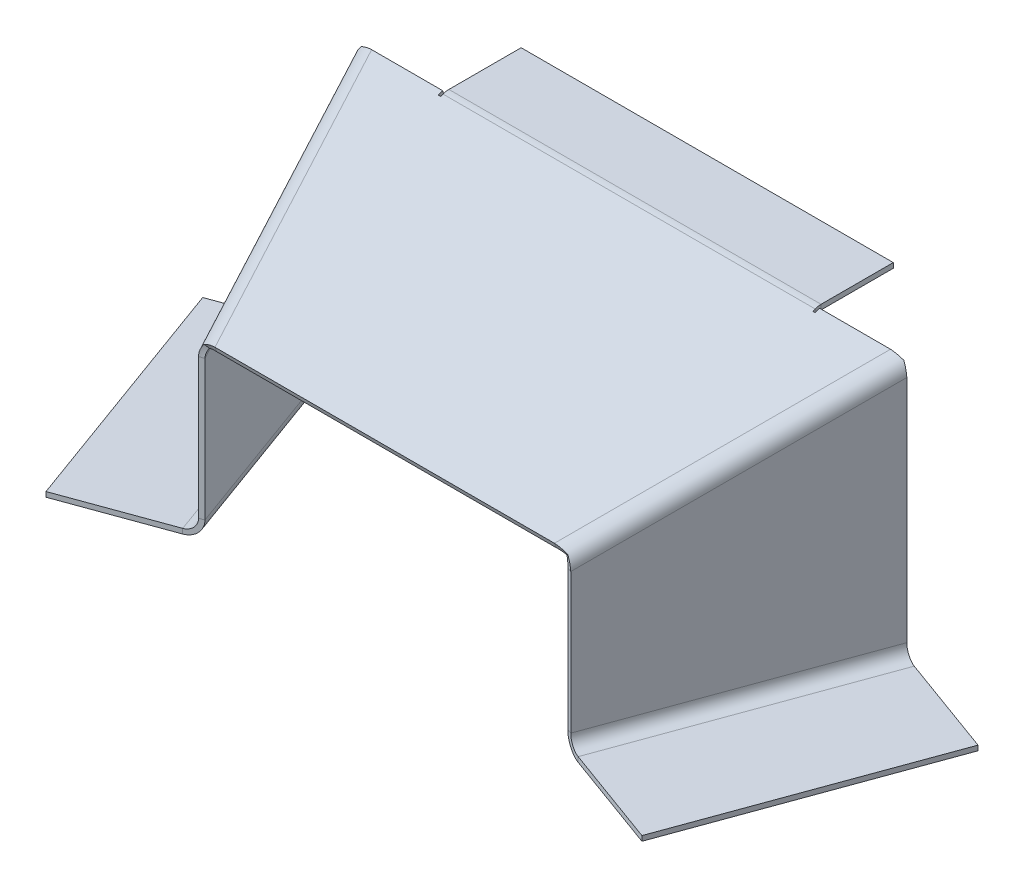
ISO-10303-21;
HEADER;
FILE_DESCRIPTION(('STEP AP214'),'2;1');
FILE_NAME('part.step','',(''),(''),'','','');
FILE_SCHEMA(('AUTOMOTIVE_DESIGN { 1 0 10303 214 1 1 1 1 }'));
ENDSEC;
DATA;
#1=APPLICATION_CONTEXT('core data for automotive mechanical design processes');
#2=APPLICATION_PROTOCOL_DEFINITION('international standard','automotive_design',2000,#1);
#3=PRODUCT_CONTEXT('',#1,'mechanical');
#4=PRODUCT('Part','Part','',(#3));
#5=PRODUCT_RELATED_PRODUCT_CATEGORY('part','',(#4));
#6=PRODUCT_DEFINITION_FORMATION('','',#4);
#7=PRODUCT_DEFINITION_CONTEXT('part definition',#1,'design');
#8=PRODUCT_DEFINITION('design','',#6,#7);
#9=PRODUCT_DEFINITION_SHAPE('','',#8);
#10=(LENGTH_UNIT() NAMED_UNIT(*) SI_UNIT(.MILLI.,.METRE.));
#11=(NAMED_UNIT(*) PLANE_ANGLE_UNIT() SI_UNIT($,.RADIAN.));
#12=(NAMED_UNIT(*) SI_UNIT($,.STERADIAN.) SOLID_ANGLE_UNIT());
#13=UNCERTAINTY_MEASURE_WITH_UNIT(LENGTH_MEASURE(1.E-05),#10,'distance_accuracy_value','');
#14=(GEOMETRIC_REPRESENTATION_CONTEXT(3) GLOBAL_UNCERTAINTY_ASSIGNED_CONTEXT((#13)) GLOBAL_UNIT_ASSIGNED_CONTEXT((#10,
#11,#12)) REPRESENTATION_CONTEXT('',''));
#15=CARTESIAN_POINT('',(0.,0.,0.));
#16=DIRECTION('',(0.,0.,1.));
#17=DIRECTION('',(1.,0.,0.));
#18=AXIS2_PLACEMENT_3D('',#15,#16,#17);
#19=CARTESIAN_POINT('',(-75.,70.,100.));
#20=DIRECTION('',(0.,0.939692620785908,0.342020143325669));
#21=DIRECTION('',(0.,-0.342020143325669,0.939692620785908));
#22=AXIS2_PLACEMENT_3D('',#19,#20,#21);
#23=PLANE('',#22);
#24=DIRECTION('',(0.,-0.342020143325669,0.939692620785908));
#25=VECTOR('',#24,1.);
#26=CARTESIAN_POINT('',(76.0000000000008,70.0000000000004,99.999999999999));
#27=LINE('',#26,#25);
#28=CARTESIAN_POINT('',(76.,105.504496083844,2.45219872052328));
#29=VERTEX_POINT('',#28);
#30=CARTESIAN_POINT('',(76.,106.14805312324,0.684040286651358));
#31=VERTEX_POINT('',#30);
#32=EDGE_CURVE('E425',#29,#31,#27,.F.);
#33=ORIENTED_EDGE('',*,*,#32,.F.);
#34=DIRECTION('',(-1.,0.,0.));
#35=VECTOR('',#34,1.);
#36=CARTESIAN_POINT('',(-75.,105.504496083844,2.45219872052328));
#37=LINE('',#36,#35);
#38=CARTESIAN_POINT('',(75.,105.504496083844,2.45219872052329));
#39=VERTEX_POINT('',#38);
#40=EDGE_CURVE('E423',#39,#29,#37,.F.);
#41=ORIENTED_EDGE('',*,*,#40,.F.);
#42=DIRECTION('',(0.,0.342020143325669,-0.939692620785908));
#43=VECTOR('',#42,1.);
#44=CARTESIAN_POINT('',(75.,70.,100.));
#45=LINE('',#44,#43);
#46=CARTESIAN_POINT('',(75.,105.84651622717,1.51250609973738));
#47=VERTEX_POINT('',#46);
#48=EDGE_CURVE('E421',#47,#39,#45,.F.);
#49=ORIENTED_EDGE('',*,*,#48,.F.);
#50=DIRECTION('',(1.,0.,0.));
#51=VECTOR('',#50,1.);
#52=CARTESIAN_POINT('',(75.,105.84651622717,1.51250609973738));
#53=LINE('',#52,#51);
#54=CARTESIAN_POINT('',(-74.9999999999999,105.84651622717,1.51250609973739));
#55=VERTEX_POINT('',#54);
#56=EDGE_CURVE('E362',#47,#55,#53,.F.);
#57=ORIENTED_EDGE('',*,*,#56,.T.);
#58=DIRECTION('',(0.,-0.342020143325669,0.939692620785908));
#59=VECTOR('',#58,1.);
#60=CARTESIAN_POINT('',(-74.9999999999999,70.,100.));
#61=LINE('',#60,#59);
#62=CARTESIAN_POINT('',(-74.9999999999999,105.504496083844,2.4521987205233));
#63=VERTEX_POINT('',#62);
#64=EDGE_CURVE('E419',#63,#55,#61,.F.);
#65=ORIENTED_EDGE('',*,*,#64,.F.);
#66=DIRECTION('',(-1.,0.,0.));
#67=VECTOR('',#66,1.);
#68=CARTESIAN_POINT('',(-75.,105.504496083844,2.4521987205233));
#69=LINE('',#68,#67);
#70=CARTESIAN_POINT('',(-75.9999999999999,105.504496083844,2.4521987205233));
#71=VERTEX_POINT('',#70);
#72=EDGE_CURVE('E417',#71,#63,#69,.F.);
#73=ORIENTED_EDGE('',*,*,#72,.F.);
#74=DIRECTION('',(0.,0.342020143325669,-0.939692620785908));
#75=VECTOR('',#74,1.);
#76=CARTESIAN_POINT('',(-76.0000000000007,70.,100.));
#77=LINE('',#76,#75);
#78=CARTESIAN_POINT('',(-75.9999999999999,106.14805312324,0.684040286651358));
#79=VERTEX_POINT('',#78);
#80=EDGE_CURVE('E389',#79,#71,#77,.F.);
#81=ORIENTED_EDGE('',*,*,#80,.F.);
#82=DIRECTION('',(1.,0.,0.));
#83=VECTOR('',#82,1.);
#84=CARTESIAN_POINT('',(0.,106.14805312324,0.684040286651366));
#85=LINE('',#84,#83);
#86=CARTESIAN_POINT('',(-104.570204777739,106.14805312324,0.684040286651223));
#87=VERTEX_POINT('',#86);
#88=EDGE_CURVE('E92',#79,#87,#85,.F.);
#89=ORIENTED_EDGE('',*,*,#88,.T.);
#90=DIRECTION('',(0.323615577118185,-0.323615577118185,0.889126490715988));
#91=VECTOR('',#90,1.);
#92=CARTESIAN_POINT('',(-68.4221516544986,70.,100.));
#93=LINE('',#92,#91);
#94=CARTESIAN_POINT('',(-68.4221516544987,70.,99.9999999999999));
#95=VERTEX_POINT('',#94);
#96=EDGE_CURVE('E897',#95,#87,#93,.F.);
#97=ORIENTED_EDGE('',*,*,#96,.F.);
#98=DIRECTION('',(-1.,0.,0.));
#99=VECTOR('',#98,1.);
#100=CARTESIAN_POINT('',(-75.,70.,100.));
#101=LINE('',#100,#99);
#102=CARTESIAN_POINT('',(68.4221516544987,70.,100.));
#103=VERTEX_POINT('',#102);
#104=EDGE_CURVE('E1172',#103,#95,#101,.T.);
#105=ORIENTED_EDGE('',*,*,#104,.F.);
#106=DIRECTION('',(0.323615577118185,0.323615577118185,-0.889126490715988));
#107=VECTOR('',#106,1.);
#108=CARTESIAN_POINT('',(104.570204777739,106.14805312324,0.684040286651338));
#109=LINE('',#108,#107);
#110=CARTESIAN_POINT('',(104.570204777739,106.14805312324,0.684040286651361));
#111=VERTEX_POINT('',#110);
#112=EDGE_CURVE('E846',#111,#103,#109,.F.);
#113=ORIENTED_EDGE('',*,*,#112,.F.);
#114=EDGE_CURVE('E905',#111,#31,#85,.F.);
#115=ORIENTED_EDGE('',*,*,#114,.T.);
#116=EDGE_LOOP('',(#33,#41,#49,#57,#65,#73,#81,#89,#97,#105,#113,#115));
#117=FACE_BOUND('',#116,.T.);
#118=ADVANCED_FACE('F88',(#117),#23,.T.);
#119=CARTESIAN_POINT('',(0.,-334.246299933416,-159.606395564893));
#120=DIRECTION('',(0.,0.342020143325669,-0.939692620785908));
#121=DIRECTION('',(0.,0.939692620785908,0.342020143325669));
#122=AXIS2_PLACEMENT_3D('',#119,#120,#121);
#123=PLANE('',#122);
#124=DIRECTION('',(1.,0.,0.));
#125=VECTOR('',#124,1.);
#126=CARTESIAN_POINT('',(0.,104.268667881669,0.));
#127=LINE('',#126,#125);
#128=CARTESIAN_POINT('',(104.570204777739,104.268667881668,0.));
#129=VERTEX_POINT('',#128);
#130=CARTESIAN_POINT('',(76.,104.268667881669,0.));
#131=VERTEX_POINT('',#130);
#132=EDGE_CURVE('E936',#129,#131,#127,.F.);
#133=ORIENTED_EDGE('',*,*,#132,.T.);
#134=DIRECTION('',(0.,0.939692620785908,0.342020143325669));
#135=VECTOR('',#134,1.);
#136=CARTESIAN_POINT('',(76.,104.268667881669,0.));
#137=LINE('',#136,#135);
#138=EDGE_CURVE('E390',#131,#31,#137,.T.);
#139=ORIENTED_EDGE('',*,*,#138,.T.);
#140=ORIENTED_EDGE('',*,*,#114,.F.);
#141=CARTESIAN_POINT('',(104.570204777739,104.268667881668,0.));
#142=CARTESIAN_POINT('',(104.570204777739,106.14805312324,0.684040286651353));
#143=B_SPLINE_CURVE_WITH_KNOTS('',1,(#141,#142),.UNSPECIFIED.,.F.,.F.,(2,2),(0.,1.),.UNSPECIFIED.);
#144=EDGE_CURVE('E921',#129,#111,#143,.T.);
#145=ORIENTED_EDGE('',*,*,#144,.F.);
#146=EDGE_LOOP('',(#133,#139,#140,#145));
#147=FACE_BOUND('',#146,.T.);
#148=ADVANCED_FACE('F883',(#147),#123,.T.);
#149=ORIENTED_EDGE('',*,*,#88,.F.);
#150=DIRECTION('',(0.,0.939692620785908,0.342020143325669));
#151=VECTOR('',#150,1.);
#152=CARTESIAN_POINT('',(-75.9999999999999,104.268667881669,0.));
#153=LINE('',#152,#151);
#154=CARTESIAN_POINT('',(-75.9999999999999,104.268667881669,0.));
#155=VERTEX_POINT('',#154);
#156=EDGE_CURVE('E405',#155,#79,#153,.T.);
#157=ORIENTED_EDGE('',*,*,#156,.F.);
#158=CARTESIAN_POINT('',(-104.570204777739,104.268667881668,0.));
#159=VERTEX_POINT('',#158);
#160=EDGE_CURVE('E904',#155,#159,#127,.F.);
#161=ORIENTED_EDGE('',*,*,#160,.T.);
#162=CARTESIAN_POINT('',(-104.570204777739,106.14805312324,0.684040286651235));
#163=CARTESIAN_POINT('',(-104.570204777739,104.268667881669,-1.29670579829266E-13));
#164=B_SPLINE_CURVE_WITH_KNOTS('',1,(#162,#163),.UNSPECIFIED.,.F.,.F.,(2,2),(0.,1.),.UNSPECIFIED.);
#165=EDGE_CURVE('E677',#159,#87,#164,.F.);
#166=ORIENTED_EDGE('',*,*,#165,.T.);
#167=EDGE_LOOP('',(#149,#157,#161,#166));
#168=FACE_BOUND('',#167,.T.);
#169=ADVANCED_FACE('F918',(#168),#123,.T.);
#170=CARTESIAN_POINT('',(-75.,68.1206147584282,99.3159597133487));
#171=DIRECTION('',(0.,0.939692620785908,0.342020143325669));
#172=DIRECTION('',(0.,-0.342020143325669,0.939692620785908));
#173=AXIS2_PLACEMENT_3D('',#170,#171,#172);
#174=PLANE('',#173);
#175=DIRECTION('',(-1.,0.,0.));
#176=VECTOR('',#175,1.);
#177=CARTESIAN_POINT('',(76.,103.625110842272,1.76815843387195));
#178=LINE('',#177,#176);
#179=CARTESIAN_POINT('',(76.,103.625110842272,1.76815843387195));
#180=VERTEX_POINT('',#179);
#181=CARTESIAN_POINT('',(75.,103.625110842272,1.76815843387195));
#182=VERTEX_POINT('',#181);
#183=EDGE_CURVE('E391',#180,#182,#178,.T.);
#184=ORIENTED_EDGE('',*,*,#183,.F.);
#185=DIRECTION('',(0.,-0.342020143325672,0.939692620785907));
#186=VECTOR('',#185,1.);
#187=CARTESIAN_POINT('',(76.,104.268667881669,0.));
#188=LINE('',#187,#186);
#189=EDGE_CURVE('E386',#131,#180,#188,.T.);
#190=ORIENTED_EDGE('',*,*,#189,.F.);
#191=ORIENTED_EDGE('',*,*,#132,.F.);
#192=DIRECTION('',(0.323615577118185,0.323615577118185,-0.889126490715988));
#193=VECTOR('',#192,1.);
#194=CARTESIAN_POINT('',(104.570204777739,104.268667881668,0.));
#195=LINE('',#194,#193);
#196=CARTESIAN_POINT('',(68.4221516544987,68.1206147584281,99.3159597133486));
#197=VERTEX_POINT('',#196);
#198=EDGE_CURVE('E922',#129,#197,#195,.F.);
#199=ORIENTED_EDGE('',*,*,#198,.T.);
#200=DIRECTION('',(1.,0.,0.));
#201=VECTOR('',#200,1.);
#202=CARTESIAN_POINT('',(-75.,68.1206147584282,99.3159597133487));
#203=LINE('',#202,#201);
#204=CARTESIAN_POINT('',(-68.4221516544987,68.1206147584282,99.3159597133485));
#205=VERTEX_POINT('',#204);
#206=EDGE_CURVE('E933',#197,#205,#203,.F.);
#207=ORIENTED_EDGE('',*,*,#206,.T.);
#208=DIRECTION('',(0.323615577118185,-0.323615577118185,0.889126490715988));
#209=VECTOR('',#208,1.);
#210=CARTESIAN_POINT('',(-68.4221516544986,68.1206147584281,99.3159597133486));
#211=LINE('',#210,#209);
#212=EDGE_CURVE('E858',#205,#159,#211,.F.);
#213=ORIENTED_EDGE('',*,*,#212,.T.);
#214=ORIENTED_EDGE('',*,*,#160,.F.);
#215=DIRECTION('',(0.,0.34202014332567,-0.939692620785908));
#216=VECTOR('',#215,1.);
#217=CARTESIAN_POINT('',(-75.9999999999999,103.625110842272,1.76815843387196));
#218=LINE('',#217,#216);
#219=CARTESIAN_POINT('',(-75.9999999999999,103.625110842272,1.76815843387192));
#220=VERTEX_POINT('',#219);
#221=EDGE_CURVE('E403',#220,#155,#218,.T.);
#222=ORIENTED_EDGE('',*,*,#221,.F.);
#223=DIRECTION('',(-1.,0.,0.));
#224=VECTOR('',#223,1.);
#225=CARTESIAN_POINT('',(-74.9999999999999,103.625110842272,1.76815843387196));
#226=LINE('',#225,#224);
#227=CARTESIAN_POINT('',(-74.9999999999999,103.625110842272,1.76815843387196));
#228=VERTEX_POINT('',#227);
#229=EDGE_CURVE('E106',#228,#220,#226,.T.);
#230=ORIENTED_EDGE('',*,*,#229,.F.);
#231=DIRECTION('',(0.,-0.342020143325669,0.939692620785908));
#232=VECTOR('',#231,1.);
#233=CARTESIAN_POINT('',(-74.9999999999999,103.967130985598,0.828465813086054));
#234=LINE('',#233,#232);
#235=CARTESIAN_POINT('',(-74.9999999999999,103.967130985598,0.828465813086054));
#236=VERTEX_POINT('',#235);
#237=EDGE_CURVE('E398',#236,#228,#234,.T.);
#238=ORIENTED_EDGE('',*,*,#237,.F.);
#239=DIRECTION('',(1.,0.,0.));
#240=VECTOR('',#239,1.);
#241=CARTESIAN_POINT('',(75.,103.967130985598,0.828465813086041));
#242=LINE('',#241,#240);
#243=CARTESIAN_POINT('',(75.,103.967130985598,0.828465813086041));
#244=VERTEX_POINT('',#243);
#245=EDGE_CURVE('E375',#244,#236,#242,.F.);
#246=ORIENTED_EDGE('',*,*,#245,.F.);
#247=DIRECTION('',(0.,0.342020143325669,-0.939692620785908));
#248=VECTOR('',#247,1.);
#249=CARTESIAN_POINT('',(75.,103.625110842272,1.76815843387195));
#250=LINE('',#249,#248);
#251=EDGE_CURVE('E395',#182,#244,#250,.T.);
#252=ORIENTED_EDGE('',*,*,#251,.F.);
#253=EDGE_LOOP('',(#184,#190,#191,#199,#207,#213,#214,#222,#230,#238,#246,#252));
#254=FACE_BOUND('',#253,.T.);
#255=ADVANCED_FACE('F876',(#254),#174,.F.);
#256=CARTESIAN_POINT('',(-235.812751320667,0.,-125.599364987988));
#257=DIRECTION('',(0.34202014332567,0.,-0.939692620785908));
#258=DIRECTION('',(-0.204437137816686,0.976047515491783,-0.0744090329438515));
#259=AXIS2_PLACEMENT_3D('',#256,#257,#258);
#260=PLANE('',#259);
#261=DIRECTION('',(0.,-1.,0.));
#262=VECTOR('',#261,1.);
#263=CARTESIAN_POINT('',(111.14805312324,0.,0.684040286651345));
#264=LINE('',#263,#262);
#265=CARTESIAN_POINT('',(111.14805312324,7.,0.684040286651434));
#266=VERTEX_POINT('',#265);
#267=CARTESIAN_POINT('',(111.14805312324,99.570204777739,0.684040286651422));
#268=VERTEX_POINT('',#267);
#269=EDGE_CURVE('E956',#266,#268,#264,.F.);
#270=ORIENTED_EDGE('',*,*,#269,.F.);
#271=DIRECTION('',(-0.939692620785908,0.,-0.342020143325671));
#272=VECTOR('',#271,1.);
#273=CARTESIAN_POINT('',(111.14805312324,7.,0.684040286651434));
#274=LINE('',#273,#272);
#275=CARTESIAN_POINT('',(109.268667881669,7.,0.));
#276=VERTEX_POINT('',#275);
#277=EDGE_CURVE('E464',#266,#276,#274,.T.);
#278=ORIENTED_EDGE('',*,*,#277,.T.);
#279=DIRECTION('',(0.,-1.,0.));
#280=VECTOR('',#279,1.);
#281=CARTESIAN_POINT('',(109.268667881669,0.,0.));
#282=LINE('',#281,#280);
#283=CARTESIAN_POINT('',(109.268667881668,99.570204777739,0.));
#284=VERTEX_POINT('',#283);
#285=EDGE_CURVE('E823',#276,#284,#282,.F.);
#286=ORIENTED_EDGE('',*,*,#285,.T.);
#287=CARTESIAN_POINT('',(111.14805312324,99.570204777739,0.68404028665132));
#288=CARTESIAN_POINT('',(109.268667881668,99.570204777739,0.));
#289=B_SPLINE_CURVE_WITH_KNOTS('',1,(#287,#288),.UNSPECIFIED.,.F.,.F.,(2,2),(0.,1.),.UNSPECIFIED.);
#290=EDGE_CURVE('E831',#284,#268,#289,.F.);
#291=ORIENTED_EDGE('',*,*,#290,.T.);
#292=EDGE_LOOP('',(#270,#278,#286,#291));
#293=FACE_BOUND('',#292,.T.);
#294=ADVANCED_FACE('F871',(#293),#260,.T.);
#295=CARTESIAN_POINT('',(75.,0.,100.));
#296=DIRECTION('',(0.939692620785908,0.,0.34202014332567));
#297=DIRECTION('',(0.34202014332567,0.,-0.939692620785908));
#298=AXIS2_PLACEMENT_3D('',#295,#296,#297);
#299=PLANE('',#298);
#300=DIRECTION('',(0.342020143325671,0.,-0.939692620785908));
#301=VECTOR('',#300,1.);
#302=CARTESIAN_POINT('',(111.14805312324,7.,0.684040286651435));
#303=LINE('',#302,#301);
#304=CARTESIAN_POINT('',(74.9999999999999,6.99999999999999,100.));
#305=VERTEX_POINT('',#304);
#306=EDGE_CURVE('E470',#266,#305,#303,.F.);
#307=ORIENTED_EDGE('',*,*,#306,.F.);
#308=ORIENTED_EDGE('',*,*,#269,.T.);
#309=DIRECTION('',(0.323615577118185,0.323615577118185,-0.889126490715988));
#310=VECTOR('',#309,1.);
#311=CARTESIAN_POINT('',(111.14805312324,99.570204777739,0.684040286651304));
#312=LINE('',#311,#310);
#313=CARTESIAN_POINT('',(75.,63.4221516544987,100.));
#314=VERTEX_POINT('',#313);
#315=EDGE_CURVE('E958',#268,#314,#312,.F.);
#316=ORIENTED_EDGE('',*,*,#315,.T.);
#317=DIRECTION('',(0.,1.,0.));
#318=VECTOR('',#317,1.);
#319=CARTESIAN_POINT('',(75.,0.,100.));
#320=LINE('',#319,#318);
#321=EDGE_CURVE('E959',#305,#314,#320,.T.);
#322=ORIENTED_EDGE('',*,*,#321,.F.);
#323=EDGE_LOOP('',(#307,#308,#316,#322));
#324=FACE_BOUND('',#323,.T.);
#325=ADVANCED_FACE('F869',(#324),#299,.T.);
#326=CARTESIAN_POINT('',(-271.960804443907,0.,-26.2834052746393));
#327=DIRECTION('',(0.34202014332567,0.,-0.939692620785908));
#328=DIRECTION('',(-0.204437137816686,0.976047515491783,-0.0744090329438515));
#329=AXIS2_PLACEMENT_3D('',#326,#327,#328);
#330=PLANE('',#329);
#331=DIRECTION('',(-0.939692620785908,0.,-0.342020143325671));
#332=VECTOR('',#331,1.);
#333=CARTESIAN_POINT('',(74.9999999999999,6.99999999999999,100.));
#334=LINE('',#333,#332);
#335=CARTESIAN_POINT('',(73.1206147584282,6.99999999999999,99.3159597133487));
#336=VERTEX_POINT('',#335);
#337=EDGE_CURVE('E474',#305,#336,#334,.T.);
#338=ORIENTED_EDGE('',*,*,#337,.F.);
#339=ORIENTED_EDGE('',*,*,#321,.T.);
#340=CARTESIAN_POINT('',(73.1206147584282,63.4221516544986,99.3159597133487));
#341=CARTESIAN_POINT('',(75.,63.4221516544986,100.));
#342=B_SPLINE_CURVE_WITH_KNOTS('',1,(#340,#341),.UNSPECIFIED.,.F.,.F.,(2,2),(0.,1.),.UNSPECIFIED.);
#343=CARTESIAN_POINT('',(73.1206147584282,63.4221516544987,99.3159597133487));
#344=VERTEX_POINT('',#343);
#345=EDGE_CURVE('E832',#344,#314,#342,.T.);
#346=ORIENTED_EDGE('',*,*,#345,.F.);
#347=DIRECTION('',(0.,-1.,0.));
#348=VECTOR('',#347,1.);
#349=CARTESIAN_POINT('',(73.1206147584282,0.,99.3159597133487));
#350=LINE('',#349,#348);
#351=EDGE_CURVE('E833',#336,#344,#350,.F.);
#352=ORIENTED_EDGE('',*,*,#351,.F.);
#353=EDGE_LOOP('',(#338,#339,#346,#352));
#354=FACE_BOUND('',#353,.T.);
#355=ADVANCED_FACE('F860',(#354),#330,.F.);
#356=CARTESIAN_POINT('',(73.1206147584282,0.,99.3159597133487));
#357=DIRECTION('',(0.939692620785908,0.,0.34202014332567));
#358=DIRECTION('',(0.34202014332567,0.,-0.939692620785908));
#359=AXIS2_PLACEMENT_3D('',#356,#357,#358);
#360=PLANE('',#359);
#361=ORIENTED_EDGE('',*,*,#285,.F.);
#362=DIRECTION('',(0.342020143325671,0.,-0.939692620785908));
#363=VECTOR('',#362,1.);
#364=CARTESIAN_POINT('',(109.268667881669,7.,0.));
#365=LINE('',#364,#363);
#366=EDGE_CURVE('E459',#276,#336,#365,.F.);
#367=ORIENTED_EDGE('',*,*,#366,.T.);
#368=ORIENTED_EDGE('',*,*,#351,.T.);
#369=DIRECTION('',(0.323615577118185,0.323615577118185,-0.889126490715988));
#370=VECTOR('',#369,1.);
#371=CARTESIAN_POINT('',(109.268667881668,99.570204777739,0.));
#372=LINE('',#371,#370);
#373=EDGE_CURVE('E843',#284,#344,#372,.F.);
#374=ORIENTED_EDGE('',*,*,#373,.F.);
#375=EDGE_LOOP('',(#361,#367,#368,#374));
#376=FACE_BOUND('',#375,.T.);
#377=ADVANCED_FACE('F812',(#376),#360,.F.);
#378=CARTESIAN_POINT('',(271.960804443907,0.,-26.2834052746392));
#379=DIRECTION('',(-0.34202014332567,0.,-0.939692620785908));
#380=DIRECTION('',(-0.204437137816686,-0.976047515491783,0.0744090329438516));
#381=AXIS2_PLACEMENT_3D('',#378,#379,#380);
#382=PLANE('',#381);
#383=DIRECTION('',(0.939692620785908,0.,-0.342020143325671));
#384=VECTOR('',#383,1.);
#385=CARTESIAN_POINT('',(-74.9999999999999,7.,100.));
#386=LINE('',#385,#384);
#387=CARTESIAN_POINT('',(-74.9999999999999,7.,100.));
#388=VERTEX_POINT('',#387);
#389=CARTESIAN_POINT('',(-73.1206147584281,7.,99.3159597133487));
#390=VERTEX_POINT('',#389);
#391=EDGE_CURVE('E516',#388,#390,#386,.T.);
#392=ORIENTED_EDGE('',*,*,#391,.T.);
#393=DIRECTION('',(0.,1.,0.));
#394=VECTOR('',#393,1.);
#395=CARTESIAN_POINT('',(-73.1206147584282,0.,99.3159597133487));
#396=LINE('',#395,#394);
#397=CARTESIAN_POINT('',(-73.1206147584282,63.4221516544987,99.3159597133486));
#398=VERTEX_POINT('',#397);
#399=EDGE_CURVE('E15',#398,#390,#396,.F.);
#400=ORIENTED_EDGE('',*,*,#399,.F.);
#401=CARTESIAN_POINT('',(-75.,63.4221516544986,100.));
#402=CARTESIAN_POINT('',(-73.1206147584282,63.4221516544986,99.3159597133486));
#403=B_SPLINE_CURVE_WITH_KNOTS('',1,(#401,#402),.UNSPECIFIED.,.F.,.F.,(2,2),(0.,1.),.UNSPECIFIED.);
#404=CARTESIAN_POINT('',(-75.,63.4221516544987,99.9999999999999));
#405=VERTEX_POINT('',#404);
#406=EDGE_CURVE('E744',#398,#405,#403,.F.);
#407=ORIENTED_EDGE('',*,*,#406,.T.);
#408=DIRECTION('',(0.,-1.,0.));
#409=VECTOR('',#408,1.);
#410=CARTESIAN_POINT('',(-75.,0.,100.));
#411=LINE('',#410,#409);
#412=EDGE_CURVE('E783',#405,#388,#411,.T.);
#413=ORIENTED_EDGE('',*,*,#412,.T.);
#414=EDGE_LOOP('',(#392,#400,#407,#413));
#415=FACE_BOUND('',#414,.T.);
#416=ADVANCED_FACE('F802',(#415),#382,.F.);
#417=CARTESIAN_POINT('',(-75.,0.,100.));
#418=DIRECTION('',(-0.939692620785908,0.,0.34202014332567));
#419=DIRECTION('',(0.34202014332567,0.,0.939692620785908));
#420=AXIS2_PLACEMENT_3D('',#417,#418,#419);
#421=PLANE('',#420);
#422=DIRECTION('',(0.342020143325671,0.,0.939692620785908));
#423=VECTOR('',#422,1.);
#424=CARTESIAN_POINT('',(-74.9999999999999,7.,100.));
#425=LINE('',#424,#423);
#426=CARTESIAN_POINT('',(-111.14805312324,6.99999999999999,0.68404028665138));
#427=VERTEX_POINT('',#426);
#428=EDGE_CURVE('E522',#388,#427,#425,.F.);
#429=ORIENTED_EDGE('',*,*,#428,.F.);
#430=ORIENTED_EDGE('',*,*,#412,.F.);
#431=DIRECTION('',(0.323615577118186,-0.323615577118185,0.889126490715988));
#432=VECTOR('',#431,1.);
#433=CARTESIAN_POINT('',(-75.,63.4221516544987,100.));
#434=LINE('',#433,#432);
#435=CARTESIAN_POINT('',(-111.14805312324,99.5702047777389,0.684040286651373));
#436=VERTEX_POINT('',#435);
#437=EDGE_CURVE('E778',#405,#436,#434,.F.);
#438=ORIENTED_EDGE('',*,*,#437,.T.);
#439=DIRECTION('',(0.,1.,0.));
#440=VECTOR('',#439,1.);
#441=CARTESIAN_POINT('',(-111.14805312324,0.,0.684040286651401));
#442=LINE('',#441,#440);
#443=EDGE_CURVE('E773',#436,#427,#442,.F.);
#444=ORIENTED_EDGE('',*,*,#443,.T.);
#445=EDGE_LOOP('',(#429,#430,#438,#444));
#446=FACE_BOUND('',#445,.T.);
#447=ADVANCED_FACE('F781',(#446),#421,.T.);
#448=CARTESIAN_POINT('',(-73.1206147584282,0.,99.3159597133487));
#449=DIRECTION('',(-0.939692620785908,0.,0.34202014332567));
#450=DIRECTION('',(0.34202014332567,0.,0.939692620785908));
#451=AXIS2_PLACEMENT_3D('',#448,#449,#450);
#452=PLANE('',#451);
#453=ORIENTED_EDGE('',*,*,#399,.T.);
#454=DIRECTION('',(0.342020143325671,0.,0.939692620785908));
#455=VECTOR('',#454,1.);
#456=CARTESIAN_POINT('',(-73.1206147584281,7.,99.3159597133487));
#457=LINE('',#456,#455);
#458=CARTESIAN_POINT('',(-109.268667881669,6.99999999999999,0.));
#459=VERTEX_POINT('',#458);
#460=EDGE_CURVE('E509',#390,#459,#457,.F.);
#461=ORIENTED_EDGE('',*,*,#460,.T.);
#462=DIRECTION('',(0.,1.,0.));
#463=VECTOR('',#462,1.);
#464=CARTESIAN_POINT('',(-109.268667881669,0.,0.));
#465=LINE('',#464,#463);
#466=CARTESIAN_POINT('',(-109.268667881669,99.570204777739,-1.16226472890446E-13));
#467=VERTEX_POINT('',#466);
#468=EDGE_CURVE('E98',#467,#459,#465,.F.);
#469=ORIENTED_EDGE('',*,*,#468,.F.);
#470=DIRECTION('',(0.323615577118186,-0.323615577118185,0.889126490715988));
#471=VECTOR('',#470,1.);
#472=CARTESIAN_POINT('',(-73.1206147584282,63.4221516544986,99.3159597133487));
#473=LINE('',#472,#471);
#474=EDGE_CURVE('E770',#398,#467,#473,.F.);
#475=ORIENTED_EDGE('',*,*,#474,.F.);
#476=EDGE_LOOP('',(#453,#461,#469,#475));
#477=FACE_BOUND('',#476,.T.);
#478=ADVANCED_FACE('F90',(#477),#452,.F.);
#479=CARTESIAN_POINT('',(235.812751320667,0.,-125.599364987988));
#480=DIRECTION('',(-0.34202014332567,0.,-0.939692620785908));
#481=DIRECTION('',(-0.204437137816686,-0.976047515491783,0.0744090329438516));
#482=AXIS2_PLACEMENT_3D('',#479,#480,#481);
#483=PLANE('',#482);
#484=DIRECTION('',(0.939692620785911,0.,-0.342020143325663));
#485=VECTOR('',#484,1.);
#486=CARTESIAN_POINT('',(-111.14805312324,6.99999999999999,0.68404028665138));
#487=LINE('',#486,#485);
#488=EDGE_CURVE('E526',#427,#459,#487,.T.);
#489=ORIENTED_EDGE('',*,*,#488,.F.);
#490=ORIENTED_EDGE('',*,*,#443,.F.);
#491=CARTESIAN_POINT('',(-109.268667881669,99.570204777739,-1.27610595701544E-13));
#492=CARTESIAN_POINT('',(-111.14805312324,99.570204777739,0.684040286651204));
#493=B_SPLINE_CURVE_WITH_KNOTS('',1,(#491,#492),.UNSPECIFIED.,.F.,.F.,(2,2),(0.,1.),.UNSPECIFIED.);
#494=EDGE_CURVE('E755',#467,#436,#493,.T.);
#495=ORIENTED_EDGE('',*,*,#494,.F.);
#496=ORIENTED_EDGE('',*,*,#468,.T.);
#497=EDGE_LOOP('',(#489,#490,#495,#496));
#498=FACE_BOUND('',#497,.T.);
#499=ADVANCED_FACE('F775',(#498),#483,.T.);
#500=CARTESIAN_POINT('',(-75.,-370.394353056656,-60.2904358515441));
#501=DIRECTION('',(0.,0.342020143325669,-0.939692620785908));
#502=DIRECTION('',(0.,0.939692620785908,0.342020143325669));
#503=AXIS2_PLACEMENT_3D('',#500,#501,#502);
#504=PLANE('',#503);
#505=CARTESIAN_POINT('',(68.4221516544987,70.,100.));
#506=CARTESIAN_POINT('',(68.4221516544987,68.1206147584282,99.3159597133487));
#507=B_SPLINE_CURVE_WITH_KNOTS('',1,(#505,#506),.UNSPECIFIED.,.F.,.F.,(2,2),(0.,1.),.UNSPECIFIED.);
#508=EDGE_CURVE('E923',#197,#103,#507,.F.);
#509=ORIENTED_EDGE('',*,*,#508,.T.);
#510=ORIENTED_EDGE('',*,*,#104,.T.);
#511=CARTESIAN_POINT('',(-68.4221516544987,68.1206147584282,99.3159597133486));
#512=CARTESIAN_POINT('',(-68.4221516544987,70.,99.9999999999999));
#513=B_SPLINE_CURVE_WITH_KNOTS('',1,(#511,#512),.UNSPECIFIED.,.F.,.F.,(2,2),(0.,1.),.UNSPECIFIED.);
#514=EDGE_CURVE('E691',#205,#95,#513,.T.);
#515=ORIENTED_EDGE('',*,*,#514,.F.);
#516=ORIENTED_EDGE('',*,*,#206,.F.);
#517=EDGE_LOOP('',(#509,#510,#515,#516));
#518=FACE_BOUND('',#517,.T.);
#519=ADVANCED_FACE('F817',(#518),#504,.F.);
#520=CARTESIAN_POINT('',(68.4221516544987,70.,100.));
#521=CARTESIAN_POINT('',(69.3049782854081,69.9865914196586,100.036839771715));
#522=CARTESIAN_POINT('',(70.1873580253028,69.8268730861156,100.020332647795));
#523=CARTESIAN_POINT('',(71.8480156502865,69.2459046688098,99.8541704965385));
#524=CARTESIAN_POINT('',(72.6256699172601,68.8249337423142,99.7044582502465));
#525=CARTESIAN_POINT('',(73.3057533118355,68.3057533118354,99.4834196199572));
#526=CARTESIAN_POINT('',(68.4221516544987,68.1206147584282,99.3159597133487));
#527=CARTESIAN_POINT('',(69.0757226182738,68.1340232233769,99.2791202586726));
#528=CARTESIAN_POINT('',(69.7289800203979,68.0429193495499,99.2041906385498));
#529=CARTESIAN_POINT('',(70.9611307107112,67.673908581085,98.9592109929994));
#530=CARTESIAN_POINT('',(71.5395829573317,67.396192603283,98.7891332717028));
#531=CARTESIAN_POINT('',(72.0483385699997,67.0483385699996,98.5680965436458));
#532=B_SPLINE_SURFACE_WITH_KNOTS('',1,3,((#520,#521,#522,#523,#524,#525),(#526,#527,#528,#529,
#530,#531)),.UNSPECIFIED.,.F.,.F.,.F.,(2,2),(4,2,4),(0.,1.),(0.,0.5,1.),.UNSPECIFIED.);
#533=CARTESIAN_POINT('',(68.4221516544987,68.1206147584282,99.3159597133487));
#534=CARTESIAN_POINT('',(69.0757226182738,68.1340232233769,99.2791202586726));
#535=CARTESIAN_POINT('',(69.7289800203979,68.0429193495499,99.2041906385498));
#536=CARTESIAN_POINT('',(70.9611307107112,67.673908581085,98.9592109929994));
#537=CARTESIAN_POINT('',(71.5395829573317,67.396192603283,98.7891332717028));
#538=CARTESIAN_POINT('',(72.0483385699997,67.0483385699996,98.5680965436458));
#539=B_SPLINE_CURVE_WITH_KNOTS('',3,(#533,#534,#535,#536,#537,#538),.UNSPECIFIED.,.F.,.F.,(4,2,
4),(0.,0.5,1.),.UNSPECIFIED.);
#540=CARTESIAN_POINT('',(72.0483385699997,67.0483385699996,98.5680965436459));
#541=VERTEX_POINT('',#540);
#542=EDGE_CURVE('E1143',#197,#541,#539,.T.);
#543=CARTESIAN_POINT('',(72.0483385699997,67.0483385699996,98.5680965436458));
#544=CARTESIAN_POINT('',(73.3057533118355,68.3057533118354,99.4834196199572));
#545=B_SPLINE_CURVE_WITH_KNOTS('',1,(#543,#544),.UNSPECIFIED.,.F.,.F.,(2,2),(0.,1.),.UNSPECIFIED.);
#546=CARTESIAN_POINT('',(73.3057526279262,68.3057538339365,99.4834198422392));
#547=VERTEX_POINT('',#546);
#548=EDGE_CURVE('E1171',#541,#547,#545,.T.);
#549=CARTESIAN_POINT('',(73.3057533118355,68.3057533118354,99.4834196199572));
#550=CARTESIAN_POINT('',(72.6256699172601,68.8249337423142,99.7044582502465));
#551=CARTESIAN_POINT('',(71.8480156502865,69.2459046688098,99.8541704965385));
#552=CARTESIAN_POINT('',(70.1873580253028,69.8268730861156,100.020332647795));
#553=CARTESIAN_POINT('',(69.3049782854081,69.9865914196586,100.036839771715));
#554=CARTESIAN_POINT('',(68.4221516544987,70.,100.));
#555=B_SPLINE_CURVE_WITH_KNOTS('',3,(#549,#550,#551,#552,#553,#554),.UNSPECIFIED.,.F.,.F.,(4,2,
4),(0.,0.5,1.),.UNSPECIFIED.);
#556=EDGE_CURVE('E1007',#103,#547,#555,.F.);
#557=ORIENTED_EDGE('',*,*,#508,.F.);
#558=ORIENTED_EDGE('',*,*,#542,.T.);
#559=ORIENTED_EDGE('',*,*,#548,.T.);
#560=ORIENTED_EDGE('',*,*,#556,.F.);
#561=EDGE_LOOP('',(#557,#558,#559,#560));
#562=FACE_BOUND('',#561,.T.);
#563=ADVANCED_FACE('F881',(#562),#532,.T.);
#564=CARTESIAN_POINT('',(73.3057533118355,68.3057533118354,99.4834196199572));
#565=CARTESIAN_POINT('',(73.8249337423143,67.62566991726,99.7044582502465));
#566=CARTESIAN_POINT('',(74.2459046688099,66.8480156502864,99.8541704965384));
#567=CARTESIAN_POINT('',(74.8268730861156,65.1873580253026,100.020332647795));
#568=CARTESIAN_POINT('',(74.9865914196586,64.304978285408,100.036839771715));
#569=CARTESIAN_POINT('',(75.,63.4221516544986,100.));
#570=CARTESIAN_POINT('',(72.0483385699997,67.0483385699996,98.5680965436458));
#571=CARTESIAN_POINT('',(72.3961926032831,66.5395829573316,98.7891332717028));
#572=CARTESIAN_POINT('',(72.6739085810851,65.9611307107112,98.9592109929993));
#573=CARTESIAN_POINT('',(73.0429193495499,64.7289800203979,99.2041906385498));
#574=CARTESIAN_POINT('',(73.1340232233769,64.0757226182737,99.2791202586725));
#575=CARTESIAN_POINT('',(73.1206147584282,63.4221516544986,99.3159597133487));
#576=B_SPLINE_SURFACE_WITH_KNOTS('',1,3,((#564,#565,#566,#567,#568,#569),(#570,#571,#572,#573,
#574,#575)),.UNSPECIFIED.,.F.,.F.,.F.,(2,2),(4,2,4),(0.,1.),(0.,0.5,1.),.UNSPECIFIED.);
#577=CARTESIAN_POINT('',(72.0483385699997,67.0483385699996,98.5680965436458));
#578=CARTESIAN_POINT('',(72.3961926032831,66.5395829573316,98.7891332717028));
#579=CARTESIAN_POINT('',(72.6739085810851,65.9611307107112,98.9592109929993));
#580=CARTESIAN_POINT('',(73.0429193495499,64.7289800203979,99.2041906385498));
#581=CARTESIAN_POINT('',(73.1340232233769,64.0757226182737,99.2791202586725));
#582=CARTESIAN_POINT('',(73.1206147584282,63.4221516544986,99.3159597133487));
#583=B_SPLINE_CURVE_WITH_KNOTS('',3,(#577,#578,#579,#580,#581,#582),.UNSPECIFIED.,.F.,.F.,(4,2,
4),(0.,0.5,1.),.UNSPECIFIED.);
#584=EDGE_CURVE('E990',#541,#344,#583,.T.);
#585=CARTESIAN_POINT('',(75.,63.4221516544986,100.));
#586=CARTESIAN_POINT('',(74.9865914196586,64.304978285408,100.036839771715));
#587=CARTESIAN_POINT('',(74.8268730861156,65.1873580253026,100.020332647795));
#588=CARTESIAN_POINT('',(74.2459046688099,66.8480156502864,99.8541704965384));
#589=CARTESIAN_POINT('',(73.8249337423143,67.62566991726,99.7044582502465));
#590=CARTESIAN_POINT('',(73.3057533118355,68.3057533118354,99.4834196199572));
#591=B_SPLINE_CURVE_WITH_KNOTS('',3,(#585,#586,#587,#588,#589,#590),.UNSPECIFIED.,.F.,.F.,(4,2,
4),(0.,0.5,1.),.UNSPECIFIED.);
#592=EDGE_CURVE('E1004',#547,#314,#591,.F.);
#593=ORIENTED_EDGE('',*,*,#548,.F.);
#594=ORIENTED_EDGE('',*,*,#584,.T.);
#595=ORIENTED_EDGE('',*,*,#345,.T.);
#596=ORIENTED_EDGE('',*,*,#592,.F.);
#597=EDGE_LOOP('',(#593,#594,#595,#596));
#598=FACE_BOUND('',#597,.T.);
#599=ADVANCED_FACE('F1014',(#598),#576,.T.);
#600=CARTESIAN_POINT('',(111.14805312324,99.570204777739,0.68404028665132));
#601=CARTESIAN_POINT('',(111.134644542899,100.453031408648,0.720880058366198));
#602=CARTESIAN_POINT('',(110.974926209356,101.335411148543,0.704372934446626));
#603=CARTESIAN_POINT('',(110.39395779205,102.996068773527,0.538210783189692));
#604=CARTESIAN_POINT('',(109.972986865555,103.7737230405,0.388498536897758));
#605=CARTESIAN_POINT('',(109.453806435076,104.453806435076,0.167459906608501));
#606=CARTESIAN_POINT('',(109.268667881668,99.570204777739,0.));
#607=CARTESIAN_POINT('',(109.282076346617,100.223775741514,-0.0368394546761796));
#608=CARTESIAN_POINT('',(109.19097247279,100.877033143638,-0.111769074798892));
#609=CARTESIAN_POINT('',(108.821961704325,102.109183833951,-0.356748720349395));
#610=CARTESIAN_POINT('',(108.544245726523,102.687636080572,-0.526826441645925));
#611=CARTESIAN_POINT('',(108.19639169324,103.19639169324,-0.747863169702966));
#612=B_SPLINE_SURFACE_WITH_KNOTS('',1,3,((#600,#601,#602,#603,#604,#605),(#606,#607,#608,#609,
#610,#611)),.UNSPECIFIED.,.F.,.F.,.F.,(2,2),(4,2,4),(0.,1.),(0.,0.5,1.),.UNSPECIFIED.);
#613=CARTESIAN_POINT('',(109.268667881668,99.570204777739,0.));
#614=CARTESIAN_POINT('',(109.282076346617,100.223775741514,-0.0368394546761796));
#615=CARTESIAN_POINT('',(109.19097247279,100.877033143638,-0.111769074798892));
#616=CARTESIAN_POINT('',(108.821961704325,102.109183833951,-0.356748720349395));
#617=CARTESIAN_POINT('',(108.544245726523,102.687636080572,-0.526826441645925));
#618=CARTESIAN_POINT('',(108.19639169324,103.19639169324,-0.747863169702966));
#619=B_SPLINE_CURVE_WITH_KNOTS('',3,(#613,#614,#615,#616,#617,#618),.UNSPECIFIED.,.F.,.F.,(4,2,
4),(0.,0.5,1.),.UNSPECIFIED.);
#620=CARTESIAN_POINT('',(108.19639169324,103.19639169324,-0.747863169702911));
#621=VERTEX_POINT('',#620);
#622=EDGE_CURVE('E974',#284,#621,#619,.T.);
#623=CARTESIAN_POINT('',(108.19639169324,103.19639169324,-0.747863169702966));
#624=CARTESIAN_POINT('',(109.453806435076,104.453806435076,0.167459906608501));
#625=B_SPLINE_CURVE_WITH_KNOTS('',1,(#623,#624),.UNSPECIFIED.,.F.,.F.,(2,2),(0.,1.),.UNSPECIFIED.);
#626=CARTESIAN_POINT('',(109.453806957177,104.453805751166,0.167460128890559));
#627=VERTEX_POINT('',#626);
#628=EDGE_CURVE('E1153',#621,#627,#625,.T.);
#629=CARTESIAN_POINT('',(109.453806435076,104.453806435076,0.167459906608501));
#630=CARTESIAN_POINT('',(109.972986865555,103.7737230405,0.388498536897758));
#631=CARTESIAN_POINT('',(110.39395779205,102.996068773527,0.538210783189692));
#632=CARTESIAN_POINT('',(110.974926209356,101.335411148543,0.704372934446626));
#633=CARTESIAN_POINT('',(111.134644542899,100.453031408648,0.720880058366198));
#634=CARTESIAN_POINT('',(111.14805312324,99.570204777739,0.68404028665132));
#635=B_SPLINE_CURVE_WITH_KNOTS('',3,(#629,#630,#631,#632,#633,#634),.UNSPECIFIED.,.F.,.F.,(4,2,
4),(0.,0.5,1.),.UNSPECIFIED.);
#636=EDGE_CURVE('E977',#268,#627,#635,.F.);
#637=ORIENTED_EDGE('',*,*,#290,.F.);
#638=ORIENTED_EDGE('',*,*,#622,.T.);
#639=ORIENTED_EDGE('',*,*,#628,.T.);
#640=ORIENTED_EDGE('',*,*,#636,.F.);
#641=EDGE_LOOP('',(#637,#638,#639,#640));
#642=FACE_BOUND('',#641,.T.);
#643=ADVANCED_FACE('F973',(#642),#612,.T.);
#644=CARTESIAN_POINT('',(109.453806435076,104.453806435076,0.167459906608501));
#645=CARTESIAN_POINT('',(108.7737230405,104.972986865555,0.38849853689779));
#646=CARTESIAN_POINT('',(107.996068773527,105.39395779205,0.538210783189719));
#647=CARTESIAN_POINT('',(106.335411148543,105.974926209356,0.704372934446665));
#648=CARTESIAN_POINT('',(105.453031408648,106.134644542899,0.720880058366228));
#649=CARTESIAN_POINT('',(104.570204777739,106.14805312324,0.684040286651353));
#650=CARTESIAN_POINT('',(108.19639169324,103.19639169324,-0.747863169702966));
#651=CARTESIAN_POINT('',(107.687636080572,103.544245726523,-0.526826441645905));
#652=CARTESIAN_POINT('',(107.109183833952,103.821961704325,-0.356748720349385));
#653=CARTESIAN_POINT('',(105.877033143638,104.19097247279,-0.111769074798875));
#654=CARTESIAN_POINT('',(105.223775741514,104.282076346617,-0.0368394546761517));
#655=CARTESIAN_POINT('',(104.570204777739,104.268667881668,0.));
#656=B_SPLINE_SURFACE_WITH_KNOTS('',1,3,((#644,#645,#646,#647,#648,#649),(#650,#651,#652,#653,
#654,#655)),.UNSPECIFIED.,.F.,.F.,.F.,(2,2),(4,2,4),(0.,1.),(0.,0.5,1.),.UNSPECIFIED.);
#657=CARTESIAN_POINT('',(108.19639169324,103.19639169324,-0.747863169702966));
#658=CARTESIAN_POINT('',(107.687636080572,103.544245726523,-0.526826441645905));
#659=CARTESIAN_POINT('',(107.109183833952,103.821961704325,-0.356748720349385));
#660=CARTESIAN_POINT('',(105.877033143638,104.19097247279,-0.111769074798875));
#661=CARTESIAN_POINT('',(105.223775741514,104.282076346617,-0.0368394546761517));
#662=CARTESIAN_POINT('',(104.570204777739,104.268667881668,0.));
#663=B_SPLINE_CURVE_WITH_KNOTS('',3,(#657,#658,#659,#660,#661,#662),.UNSPECIFIED.,.F.,.F.,(4,2,
4),(0.,0.5,1.),.UNSPECIFIED.);
#664=EDGE_CURVE('E988',#621,#129,#663,.T.);
#665=CARTESIAN_POINT('',(104.570204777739,106.14805312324,0.684040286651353));
#666=CARTESIAN_POINT('',(105.453031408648,106.134644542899,0.720880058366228));
#667=CARTESIAN_POINT('',(106.335411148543,105.974926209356,0.704372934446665));
#668=CARTESIAN_POINT('',(107.996068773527,105.39395779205,0.538210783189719));
#669=CARTESIAN_POINT('',(108.7737230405,104.972986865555,0.38849853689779));
#670=CARTESIAN_POINT('',(109.453806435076,104.453806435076,0.167459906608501));
#671=B_SPLINE_CURVE_WITH_KNOTS('',3,(#665,#666,#667,#668,#669,#670),.UNSPECIFIED.,.F.,.F.,(4,2,
4),(0.,0.5,1.),.UNSPECIFIED.);
#672=EDGE_CURVE('E1170',#627,#111,#671,.F.);
#673=ORIENTED_EDGE('',*,*,#628,.F.);
#674=ORIENTED_EDGE('',*,*,#664,.T.);
#675=ORIENTED_EDGE('',*,*,#144,.T.);
#676=ORIENTED_EDGE('',*,*,#672,.F.);
#677=EDGE_LOOP('',(#673,#674,#675,#676));
#678=FACE_BOUND('',#677,.T.);
#679=ADVANCED_FACE('F1083',(#678),#656,.T.);
#680=CARTESIAN_POINT('',(238.039683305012,233.039683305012,-368.414479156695));
#681=DIRECTION('',(-0.323615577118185,-0.323615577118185,0.889126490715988));
#682=DIRECTION('',(0.939692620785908,0.,0.342020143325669));
#683=AXIS2_PLACEMENT_3D('',#680,#681,#682);
#684=CYLINDRICAL_SURFACE('',#683,7.);
#685=ORIENTED_EDGE('',*,*,#672,.T.);
#686=ORIENTED_EDGE('',*,*,#112,.T.);
#687=ORIENTED_EDGE('',*,*,#556,.T.);
#688=ORIENTED_EDGE('',*,*,#592,.T.);
#689=ORIENTED_EDGE('',*,*,#315,.F.);
#690=ORIENTED_EDGE('',*,*,#636,.T.);
#691=EDGE_LOOP('',(#685,#686,#687,#688,#689,#690));
#692=FACE_BOUND('',#691,.T.);
#693=ADVANCED_FACE('F638',(#692),#684,.T.);
#694=CARTESIAN_POINT('',(238.039683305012,233.039683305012,-368.414479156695));
#695=DIRECTION('',(-0.323615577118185,-0.323615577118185,0.889126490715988));
#696=DIRECTION('',(0.939692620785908,0.,0.342020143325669));
#697=AXIS2_PLACEMENT_3D('',#694,#695,#696);
#698=CYLINDRICAL_SURFACE('',#697,5.);
#699=ORIENTED_EDGE('',*,*,#664,.F.);
#700=ORIENTED_EDGE('',*,*,#622,.F.);
#701=ORIENTED_EDGE('',*,*,#373,.T.);
#702=ORIENTED_EDGE('',*,*,#584,.F.);
#703=ORIENTED_EDGE('',*,*,#542,.F.);
#704=ORIENTED_EDGE('',*,*,#198,.F.);
#705=EDGE_LOOP('',(#699,#700,#701,#702,#703,#704));
#706=FACE_BOUND('',#705,.T.);
#707=ADVANCED_FACE('F634',(#706),#698,.F.);
#708=CARTESIAN_POINT('',(-104.570204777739,106.14805312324,0.684040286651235));
#709=CARTESIAN_POINT('',(-105.453031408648,106.134644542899,0.720880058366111));
#710=CARTESIAN_POINT('',(-106.335411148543,105.974926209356,0.704372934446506));
#711=CARTESIAN_POINT('',(-107.996068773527,105.39395779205,0.538210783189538));
#712=CARTESIAN_POINT('',(-108.7737230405,104.972986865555,0.388498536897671));
#713=CARTESIAN_POINT('',(-109.453806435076,104.453806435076,0.16745990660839));
#714=CARTESIAN_POINT('',(-104.570204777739,104.268667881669,-1.29670579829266E-13));
#715=CARTESIAN_POINT('',(-105.223775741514,104.282076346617,-0.0368394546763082));
#716=CARTESIAN_POINT('',(-105.877033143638,104.19097247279,-0.11176907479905));
#717=CARTESIAN_POINT('',(-107.109183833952,103.821961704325,-0.356748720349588));
#718=CARTESIAN_POINT('',(-107.687636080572,103.544245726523,-0.526826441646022));
#719=CARTESIAN_POINT('',(-108.19639169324,103.19639169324,-0.747863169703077));
#720=B_SPLINE_SURFACE_WITH_KNOTS('',1,3,((#708,#709,#710,#711,#712,#713),(#714,#715,#716,#717,
#718,#719)),.UNSPECIFIED.,.F.,.F.,.F.,(2,2),(4,2,4),(0.,1.),(0.,0.5,1.),.UNSPECIFIED.);
#721=CARTESIAN_POINT('',(-104.570204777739,104.268667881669,-1.29670579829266E-13));
#722=CARTESIAN_POINT('',(-105.223775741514,104.282076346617,-0.0368394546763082));
#723=CARTESIAN_POINT('',(-105.877033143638,104.19097247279,-0.11176907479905));
#724=CARTESIAN_POINT('',(-107.109183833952,103.821961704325,-0.356748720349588));
#725=CARTESIAN_POINT('',(-107.687636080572,103.544245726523,-0.526826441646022));
#726=CARTESIAN_POINT('',(-108.19639169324,103.19639169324,-0.747863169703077));
#727=B_SPLINE_CURVE_WITH_KNOTS('',3,(#721,#722,#723,#724,#725,#726),.UNSPECIFIED.,.F.,.F.,(4,2,
4),(0.,0.5,1.),.UNSPECIFIED.);
#728=CARTESIAN_POINT('',(-108.19639169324,103.19639169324,-0.747863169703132));
#729=VERTEX_POINT('',#728);
#730=EDGE_CURVE('E605',#159,#729,#727,.T.);
#731=CARTESIAN_POINT('',(-108.19639169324,103.19639169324,-0.747863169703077));
#732=CARTESIAN_POINT('',(-109.453806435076,104.453806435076,0.16745990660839));
#733=B_SPLINE_CURVE_WITH_KNOTS('',1,(#731,#732),.UNSPECIFIED.,.F.,.F.,(2,2),(0.,1.),.UNSPECIFIED.);
#734=CARTESIAN_POINT('',(-109.453805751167,104.453806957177,0.167460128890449));
#735=VERTEX_POINT('',#734);
#736=EDGE_CURVE('E667',#729,#735,#733,.T.);
#737=CARTESIAN_POINT('',(-109.453806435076,104.453806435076,0.16745990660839));
#738=CARTESIAN_POINT('',(-108.7737230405,104.972986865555,0.388498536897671));
#739=CARTESIAN_POINT('',(-107.996068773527,105.39395779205,0.538210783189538));
#740=CARTESIAN_POINT('',(-106.335411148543,105.974926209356,0.704372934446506));
#741=CARTESIAN_POINT('',(-105.453031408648,106.134644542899,0.720880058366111));
#742=CARTESIAN_POINT('',(-104.570204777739,106.14805312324,0.684040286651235));
#743=B_SPLINE_CURVE_WITH_KNOTS('',3,(#737,#738,#739,#740,#741,#742),.UNSPECIFIED.,.F.,.F.,(4,2,
4),(0.,0.5,1.),.UNSPECIFIED.);
#744=EDGE_CURVE('E595',#87,#735,#743,.F.);
#745=ORIENTED_EDGE('',*,*,#165,.F.);
#746=ORIENTED_EDGE('',*,*,#730,.T.);
#747=ORIENTED_EDGE('',*,*,#736,.T.);
#748=ORIENTED_EDGE('',*,*,#744,.F.);
#749=EDGE_LOOP('',(#745,#746,#747,#748));
#750=FACE_BOUND('',#749,.T.);
#751=ADVANCED_FACE('F622',(#750),#720,.T.);
#752=CARTESIAN_POINT('',(-109.453806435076,104.453806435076,0.16745990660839));
#753=CARTESIAN_POINT('',(-109.972986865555,103.7737230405,0.388498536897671));
#754=CARTESIAN_POINT('',(-110.39395779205,102.996068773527,0.538210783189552));
#755=CARTESIAN_POINT('',(-110.974926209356,101.335411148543,0.704372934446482));
#756=CARTESIAN_POINT('',(-111.134644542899,100.453031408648,0.720880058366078));
#757=CARTESIAN_POINT('',(-111.14805312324,99.570204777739,0.684040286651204));
#758=CARTESIAN_POINT('',(-108.19639169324,103.19639169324,-0.747863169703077));
#759=CARTESIAN_POINT('',(-108.544245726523,102.687636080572,-0.526826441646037));
#760=CARTESIAN_POINT('',(-108.821961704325,102.109183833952,-0.356748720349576));
#761=CARTESIAN_POINT('',(-109.19097247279,100.877033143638,-0.111769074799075));
#762=CARTESIAN_POINT('',(-109.282076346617,100.223775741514,-0.0368394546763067));
#763=CARTESIAN_POINT('',(-109.268667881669,99.570204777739,-1.27610595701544E-13));
#764=B_SPLINE_SURFACE_WITH_KNOTS('',1,3,((#752,#753,#754,#755,#756,#757),(#758,#759,#760,#761,
#762,#763)),.UNSPECIFIED.,.F.,.F.,.F.,(2,2),(4,2,4),(0.,1.),(0.,0.5,1.),.UNSPECIFIED.);
#765=CARTESIAN_POINT('',(-108.19639169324,103.19639169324,-0.747863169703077));
#766=CARTESIAN_POINT('',(-108.544245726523,102.687636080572,-0.526826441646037));
#767=CARTESIAN_POINT('',(-108.821961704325,102.109183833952,-0.356748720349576));
#768=CARTESIAN_POINT('',(-109.19097247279,100.877033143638,-0.111769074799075));
#769=CARTESIAN_POINT('',(-109.282076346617,100.223775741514,-0.0368394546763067));
#770=CARTESIAN_POINT('',(-109.268667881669,99.570204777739,-1.27610595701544E-13));
#771=B_SPLINE_CURVE_WITH_KNOTS('',3,(#765,#766,#767,#768,#769,#770),.UNSPECIFIED.,.F.,.F.,(4,2,
4),(0.,0.5,1.),.UNSPECIFIED.);
#772=EDGE_CURVE('E765',#729,#467,#771,.T.);
#773=CARTESIAN_POINT('',(-111.14805312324,99.570204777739,0.684040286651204));
#774=CARTESIAN_POINT('',(-111.134644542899,100.453031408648,0.720880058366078));
#775=CARTESIAN_POINT('',(-110.974926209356,101.335411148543,0.704372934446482));
#776=CARTESIAN_POINT('',(-110.39395779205,102.996068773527,0.538210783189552));
#777=CARTESIAN_POINT('',(-109.972986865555,103.7737230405,0.388498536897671));
#778=CARTESIAN_POINT('',(-109.453806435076,104.453806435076,0.16745990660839));
#779=B_SPLINE_CURVE_WITH_KNOTS('',3,(#773,#774,#775,#776,#777,#778),.UNSPECIFIED.,.F.,.F.,(4,2,
4),(0.,0.5,1.),.UNSPECIFIED.);
#780=EDGE_CURVE('E578',#735,#436,#779,.F.);
#781=ORIENTED_EDGE('',*,*,#736,.F.);
#782=ORIENTED_EDGE('',*,*,#772,.T.);
#783=ORIENTED_EDGE('',*,*,#494,.T.);
#784=ORIENTED_EDGE('',*,*,#780,.F.);
#785=EDGE_LOOP('',(#781,#782,#783,#784));
#786=FACE_BOUND('',#785,.T.);
#787=ADVANCED_FACE('F633',(#786),#764,.T.);
#788=CARTESIAN_POINT('',(-75.,63.4221516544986,100.));
#789=CARTESIAN_POINT('',(-74.9865914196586,64.304978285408,100.036839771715));
#790=CARTESIAN_POINT('',(-74.8268730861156,65.1873580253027,100.020332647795));
#791=CARTESIAN_POINT('',(-74.2459046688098,66.8480156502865,99.8541704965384));
#792=CARTESIAN_POINT('',(-73.8249337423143,67.6256699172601,99.7044582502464));
#793=CARTESIAN_POINT('',(-73.3057533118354,68.3057533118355,99.4834196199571));
#794=CARTESIAN_POINT('',(-73.1206147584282,63.4221516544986,99.3159597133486));
#795=CARTESIAN_POINT('',(-73.1340232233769,64.0757226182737,99.2791202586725));
#796=CARTESIAN_POINT('',(-73.04291934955,64.7289800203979,99.2041906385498));
#797=CARTESIAN_POINT('',(-72.673908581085,65.9611307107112,98.9592109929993));
#798=CARTESIAN_POINT('',(-72.3961926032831,66.5395829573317,98.7891332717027));
#799=CARTESIAN_POINT('',(-72.0483385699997,67.0483385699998,98.5680965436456));
#800=B_SPLINE_SURFACE_WITH_KNOTS('',1,3,((#788,#789,#790,#791,#792,#793),(#794,#795,#796,#797,
#798,#799)),.UNSPECIFIED.,.F.,.F.,.F.,(2,2),(4,2,4),(0.,1.),(0.,0.5,1.),.UNSPECIFIED.);
#801=CARTESIAN_POINT('',(-73.1206147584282,63.4221516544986,99.3159597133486));
#802=CARTESIAN_POINT('',(-73.1340232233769,64.0757226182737,99.2791202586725));
#803=CARTESIAN_POINT('',(-73.04291934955,64.7289800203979,99.2041906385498));
#804=CARTESIAN_POINT('',(-72.673908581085,65.9611307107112,98.9592109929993));
#805=CARTESIAN_POINT('',(-72.3961926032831,66.5395829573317,98.7891332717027));
#806=CARTESIAN_POINT('',(-72.0483385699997,67.0483385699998,98.5680965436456));
#807=B_SPLINE_CURVE_WITH_KNOTS('',3,(#801,#802,#803,#804,#805,#806),.UNSPECIFIED.,.F.,.F.,(4,2,
4),(0.,0.5,1.),.UNSPECIFIED.);
#808=CARTESIAN_POINT('',(-72.0483385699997,67.0483385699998,98.5680965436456));
#809=VERTEX_POINT('',#808);
#810=EDGE_CURVE('E1199',#398,#809,#807,.T.);
#811=CARTESIAN_POINT('',(-72.0483385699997,67.0483385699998,98.5680965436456));
#812=CARTESIAN_POINT('',(-73.3057533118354,68.3057533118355,99.4834196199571));
#813=B_SPLINE_CURVE_WITH_KNOTS('',1,(#811,#812),.UNSPECIFIED.,.F.,.F.,(2,2),(0.,1.),.UNSPECIFIED.);
#814=CARTESIAN_POINT('',(-73.3057538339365,68.3057526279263,99.4834198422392));
#815=VERTEX_POINT('',#814);
#816=EDGE_CURVE('E1201',#809,#815,#813,.T.);
#817=CARTESIAN_POINT('',(-73.3057533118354,68.3057533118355,99.4834196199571));
#818=CARTESIAN_POINT('',(-73.8249337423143,67.6256699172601,99.7044582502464));
#819=CARTESIAN_POINT('',(-74.2459046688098,66.8480156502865,99.8541704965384));
#820=CARTESIAN_POINT('',(-74.8268730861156,65.1873580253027,100.020332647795));
#821=CARTESIAN_POINT('',(-74.9865914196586,64.304978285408,100.036839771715));
#822=CARTESIAN_POINT('',(-75.,63.4221516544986,100.));
#823=B_SPLINE_CURVE_WITH_KNOTS('',3,(#817,#818,#819,#820,#821,#822),.UNSPECIFIED.,.F.,.F.,(4,2,
4),(0.,0.5,1.),.UNSPECIFIED.);
#824=EDGE_CURVE('E1198',#405,#815,#823,.F.);
#825=ORIENTED_EDGE('',*,*,#406,.F.);
#826=ORIENTED_EDGE('',*,*,#810,.T.);
#827=ORIENTED_EDGE('',*,*,#816,.T.);
#828=ORIENTED_EDGE('',*,*,#824,.F.);
#829=EDGE_LOOP('',(#825,#826,#827,#828));
#830=FACE_BOUND('',#829,.T.);
#831=ADVANCED_FACE('F707',(#830),#800,.T.);
#832=CARTESIAN_POINT('',(-73.3057533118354,68.3057533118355,99.4834196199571));
#833=CARTESIAN_POINT('',(-72.6256699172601,68.8249337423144,99.7044582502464));
#834=CARTESIAN_POINT('',(-71.8480156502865,69.2459046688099,99.8541704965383));
#835=CARTESIAN_POINT('',(-70.1873580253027,69.8268730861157,100.020332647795));
#836=CARTESIAN_POINT('',(-69.304978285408,69.9865914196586,100.036839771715));
#837=CARTESIAN_POINT('',(-68.4221516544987,70.,99.9999999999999));
#838=CARTESIAN_POINT('',(-72.0483385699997,67.0483385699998,98.5680965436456));
#839=CARTESIAN_POINT('',(-71.5395829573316,67.3961926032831,98.7891332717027));
#840=CARTESIAN_POINT('',(-70.9611307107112,67.6739085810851,98.9592109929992));
#841=CARTESIAN_POINT('',(-69.7289800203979,68.04291934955,99.2041906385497));
#842=CARTESIAN_POINT('',(-69.0757226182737,68.1340232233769,99.2791202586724));
#843=CARTESIAN_POINT('',(-68.4221516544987,68.1206147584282,99.3159597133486));
#844=B_SPLINE_SURFACE_WITH_KNOTS('',1,3,((#832,#833,#834,#835,#836,#837),(#838,#839,#840,#841,
#842,#843)),.UNSPECIFIED.,.F.,.F.,.F.,(2,2),(4,2,4),(0.,1.),(0.,0.5,1.),.UNSPECIFIED.);
#845=CARTESIAN_POINT('',(-72.0483385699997,67.0483385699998,98.5680965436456));
#846=CARTESIAN_POINT('',(-71.5395829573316,67.3961926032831,98.7891332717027));
#847=CARTESIAN_POINT('',(-70.9611307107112,67.6739085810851,98.9592109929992));
#848=CARTESIAN_POINT('',(-69.7289800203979,68.04291934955,99.2041906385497));
#849=CARTESIAN_POINT('',(-69.0757226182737,68.1340232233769,99.2791202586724));
#850=CARTESIAN_POINT('',(-68.4221516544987,68.1206147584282,99.3159597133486));
#851=B_SPLINE_CURVE_WITH_KNOTS('',3,(#845,#846,#847,#848,#849,#850),.UNSPECIFIED.,.F.,.F.,(4,2,
4),(0.,0.5,1.),.UNSPECIFIED.);
#852=EDGE_CURVE('E529',#809,#205,#851,.T.);
#853=CARTESIAN_POINT('',(-68.4221516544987,70.,99.9999999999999));
#854=CARTESIAN_POINT('',(-69.304978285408,69.9865914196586,100.036839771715));
#855=CARTESIAN_POINT('',(-70.1873580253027,69.8268730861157,100.020332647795));
#856=CARTESIAN_POINT('',(-71.8480156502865,69.2459046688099,99.8541704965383));
#857=CARTESIAN_POINT('',(-72.6256699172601,68.8249337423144,99.7044582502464));
#858=CARTESIAN_POINT('',(-73.3057533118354,68.3057533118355,99.4834196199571));
#859=B_SPLINE_CURVE_WITH_KNOTS('',3,(#853,#854,#855,#856,#857,#858),.UNSPECIFIED.,.F.,.F.,(4,2,
4),(0.,0.5,1.),.UNSPECIFIED.);
#860=EDGE_CURVE('E1197',#815,#95,#859,.F.);
#861=ORIENTED_EDGE('',*,*,#816,.F.);
#862=ORIENTED_EDGE('',*,*,#852,.T.);
#863=ORIENTED_EDGE('',*,*,#514,.T.);
#864=ORIENTED_EDGE('',*,*,#860,.F.);
#865=EDGE_LOOP('',(#861,#862,#863,#864));
#866=FACE_BOUND('',#865,.T.);
#867=ADVANCED_FACE('F549',(#866),#844,.T.);
#868=CARTESIAN_POINT('',(44.9051058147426,-49.9051058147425,408.96993990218));
#869=DIRECTION('',(-0.323615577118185,0.323615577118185,-0.889126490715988));
#870=DIRECTION('',(-0.939692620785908,0.,0.342020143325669));
#871=AXIS2_PLACEMENT_3D('',#868,#869,#870);
#872=CYLINDRICAL_SURFACE('',#871,7.);
#873=ORIENTED_EDGE('',*,*,#860,.T.);
#874=ORIENTED_EDGE('',*,*,#96,.T.);
#875=ORIENTED_EDGE('',*,*,#744,.T.);
#876=ORIENTED_EDGE('',*,*,#780,.T.);
#877=ORIENTED_EDGE('',*,*,#437,.F.);
#878=ORIENTED_EDGE('',*,*,#824,.T.);
#879=EDGE_LOOP('',(#873,#874,#875,#876,#877,#878));
#880=FACE_BOUND('',#879,.T.);
#881=ADVANCED_FACE('F538',(#880),#872,.T.);
#882=CARTESIAN_POINT('',(44.9051058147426,-49.9051058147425,408.96993990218));
#883=DIRECTION('',(-0.323615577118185,0.323615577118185,-0.889126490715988));
#884=DIRECTION('',(-0.939692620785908,0.,0.342020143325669));
#885=AXIS2_PLACEMENT_3D('',#882,#883,#884);
#886=CYLINDRICAL_SURFACE('',#885,5.);
#887=ORIENTED_EDGE('',*,*,#852,.F.);
#888=ORIENTED_EDGE('',*,*,#810,.F.);
#889=ORIENTED_EDGE('',*,*,#474,.T.);
#890=ORIENTED_EDGE('',*,*,#772,.F.);
#891=ORIENTED_EDGE('',*,*,#730,.F.);
#892=ORIENTED_EDGE('',*,*,#212,.F.);
#893=EDGE_LOOP('',(#887,#888,#889,#890,#891,#892));
#894=FACE_BOUND('',#893,.T.);
#895=ADVANCED_FACE('F548',(#894),#886,.F.);
#896=CARTESIAN_POINT('',(-115.84651622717,6.99999999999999,2.39414100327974));
#897=DIRECTION('',(-0.342020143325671,0.,-0.939692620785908));
#898=DIRECTION('',(-0.939692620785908,0.,0.342020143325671));
#899=AXIS2_PLACEMENT_3D('',#896,#897,#898);
#900=PLANE('',#899);
#901=DIRECTION('',(0.,1.,0.));
#902=VECTOR('',#901,1.);
#903=CARTESIAN_POINT('',(-115.84651622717,0.,2.39414100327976));
#904=LINE('',#903,#902);
#905=CARTESIAN_POINT('',(-115.84651622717,1.99999999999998,2.39414100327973));
#906=VERTEX_POINT('',#905);
#907=CARTESIAN_POINT('',(-115.84651622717,0.,2.3941410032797));
#908=VERTEX_POINT('',#907);
#909=EDGE_CURVE('E476',#906,#908,#904,.F.);
#910=ORIENTED_EDGE('',*,*,#909,.F.);
#911=CARTESIAN_POINT('',(-115.84651622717,6.99999999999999,2.39414100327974));
#912=DIRECTION('',(0.342020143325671,0.,0.939692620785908));
#913=DIRECTION('',(0.939692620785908,0.,-0.342020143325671));
#914=AXIS2_PLACEMENT_3D('',#911,#912,#913);
#915=CIRCLE('',#914,5.);
#916=EDGE_CURVE('E519',#427,#906,#915,.F.);
#917=ORIENTED_EDGE('',*,*,#916,.F.);
#918=ORIENTED_EDGE('',*,*,#488,.T.);
#919=CARTESIAN_POINT('',(-115.84651622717,6.99999999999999,2.3941410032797));
#920=DIRECTION('',(0.342020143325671,0.,0.939692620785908));
#921=DIRECTION('',(0.939692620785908,0.,-0.342020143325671));
#922=AXIS2_PLACEMENT_3D('',#919,#920,#921);
#923=CIRCLE('',#922,7.);
#924=EDGE_CURVE('E512',#459,#908,#923,.F.);
#925=ORIENTED_EDGE('',*,*,#924,.T.);
#926=EDGE_LOOP('',(#910,#917,#918,#925));
#927=FACE_BOUND('',#926,.T.);
#928=ADVANCED_FACE('F1491',(#927),#900,.T.);
#929=CARTESIAN_POINT('',(-79.6984631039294,7.,101.710100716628));
#930=DIRECTION('',(-0.342020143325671,0.,-0.939692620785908));
#931=DIRECTION('',(-0.939692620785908,0.,0.342020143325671));
#932=AXIS2_PLACEMENT_3D('',#929,#930,#931);
#933=PLANE('',#932);
#934=CARTESIAN_POINT('',(-79.6984631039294,7.,101.710100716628));
#935=DIRECTION('',(0.342020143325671,0.,0.939692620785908));
#936=DIRECTION('',(0.939692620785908,0.,-0.342020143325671));
#937=AXIS2_PLACEMENT_3D('',#934,#935,#936);
#938=CIRCLE('',#937,5.);
#939=CARTESIAN_POINT('',(-79.6984631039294,2.,101.710100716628));
#940=VERTEX_POINT('',#939);
#941=EDGE_CURVE('E482',#940,#388,#938,.T.);
#942=ORIENTED_EDGE('',*,*,#941,.F.);
#943=DIRECTION('',(0.,1.,0.));
#944=VECTOR('',#943,1.);
#945=CARTESIAN_POINT('',(-79.6984631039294,2.00000000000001,101.710100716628));
#946=LINE('',#945,#944);
#947=CARTESIAN_POINT('',(-79.6984631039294,0.,101.710100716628));
#948=VERTEX_POINT('',#947);
#949=EDGE_CURVE('E502',#940,#948,#946,.F.);
#950=ORIENTED_EDGE('',*,*,#949,.T.);
#951=CARTESIAN_POINT('',(-79.6984631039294,7.,101.710100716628));
#952=DIRECTION('',(0.342020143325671,0.,0.939692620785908));
#953=DIRECTION('',(0.939692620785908,0.,-0.342020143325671));
#954=AXIS2_PLACEMENT_3D('',#951,#952,#953);
#955=CIRCLE('',#954,7.);
#956=EDGE_CURVE('E513',#948,#390,#955,.T.);
#957=ORIENTED_EDGE('',*,*,#956,.T.);
#958=ORIENTED_EDGE('',*,*,#391,.F.);
#959=EDGE_LOOP('',(#942,#950,#957,#958));
#960=FACE_BOUND('',#959,.T.);
#961=ADVANCED_FACE('F551',(#960),#933,.F.);
#962=CARTESIAN_POINT('',(-79.6984631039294,7.,101.710100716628));
#963=DIRECTION('',(0.342020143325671,0.,0.939692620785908));
#964=DIRECTION('',(0.,-1.,0.));
#965=AXIS2_PLACEMENT_3D('',#962,#963,#964);
#966=CYLINDRICAL_SURFACE('',#965,7.);
#967=ORIENTED_EDGE('',*,*,#460,.F.);
#968=ORIENTED_EDGE('',*,*,#956,.F.);
#969=DIRECTION('',(0.34202014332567,0.,0.939692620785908));
#970=VECTOR('',#969,1.);
#971=CARTESIAN_POINT('',(-115.84651622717,0.,2.39414100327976));
#972=LINE('',#971,#970);
#973=EDGE_CURVE('E500',#948,#908,#972,.F.);
#974=ORIENTED_EDGE('',*,*,#973,.T.);
#975=ORIENTED_EDGE('',*,*,#924,.F.);
#976=EDGE_LOOP('',(#967,#968,#974,#975));
#977=FACE_BOUND('',#976,.T.);
#978=ADVANCED_FACE('F1470',(#977),#966,.T.);
#979=CARTESIAN_POINT('',(-79.6984631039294,7.,101.710100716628));
#980=DIRECTION('',(0.342020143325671,0.,0.939692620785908));
#981=DIRECTION('',(0.,-1.,0.));
#982=AXIS2_PLACEMENT_3D('',#979,#980,#981);
#983=CYLINDRICAL_SURFACE('',#982,5.);
#984=ORIENTED_EDGE('',*,*,#428,.T.);
#985=ORIENTED_EDGE('',*,*,#916,.T.);
#986=DIRECTION('',(0.34202014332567,0.,0.939692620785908));
#987=VECTOR('',#986,1.);
#988=CARTESIAN_POINT('',(-115.84651622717,1.99999999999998,2.39414100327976));
#989=LINE('',#988,#987);
#990=EDGE_CURVE('E505',#906,#940,#989,.T.);
#991=ORIENTED_EDGE('',*,*,#990,.T.);
#992=ORIENTED_EDGE('',*,*,#941,.T.);
#993=EDGE_LOOP('',(#984,#985,#991,#992));
#994=FACE_BOUND('',#993,.T.);
#995=ADVANCED_FACE('F1459',(#994),#983,.F.);
#996=CARTESIAN_POINT('',(-120.105245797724,-1.41813644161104E-13,116.416966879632));
#997=DIRECTION('',(-0.34202014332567,0.,-0.939692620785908));
#998=DIRECTION('',(-0.939692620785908,0.,0.34202014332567));
#999=AXIS2_PLACEMENT_3D('',#996,#997,#998);
#1000=PLANE('',#999);
#1001=ORIENTED_EDGE('',*,*,#949,.F.);
#1002=DIRECTION('',(0.939692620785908,0.,-0.34202014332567));
#1003=VECTOR('',#1002,1.);
#1004=CARTESIAN_POINT('',(-120.105245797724,1.99999999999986,116.416966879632));
#1005=LINE('',#1004,#1003);
#1006=CARTESIAN_POINT('',(-120.105245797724,1.99999999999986,116.416966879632));
#1007=VERTEX_POINT('',#1006);
#1008=EDGE_CURVE('E498',#940,#1007,#1005,.F.);
#1009=ORIENTED_EDGE('',*,*,#1008,.T.);
#1010=DIRECTION('',(0.,1.,0.));
#1011=VECTOR('',#1010,1.);
#1012=CARTESIAN_POINT('',(-120.105245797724,-1.41813644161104E-13,116.416966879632));
#1013=LINE('',#1012,#1011);
#1014=CARTESIAN_POINT('',(-120.105245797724,-1.41791282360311E-13,116.416966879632));
#1015=VERTEX_POINT('',#1014);
#1016=EDGE_CURVE('E479',#1015,#1007,#1013,.T.);
#1017=ORIENTED_EDGE('',*,*,#1016,.F.);
#1018=DIRECTION('',(-0.939692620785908,0.,0.34202014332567));
#1019=VECTOR('',#1018,1.);
#1020=CARTESIAN_POINT('',(23.3660471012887,3.97845603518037E-13,64.1976867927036));
#1021=LINE('',#1020,#1019);
#1022=EDGE_CURVE('E491',#948,#1015,#1021,.T.);
#1023=ORIENTED_EDGE('',*,*,#1022,.F.);
#1024=EDGE_LOOP('',(#1001,#1009,#1017,#1023));
#1025=FACE_BOUND('',#1024,.T.);
#1026=ADVANCED_FACE('F1448',(#1025),#1000,.F.);
#1027=CARTESIAN_POINT('',(-111.14805312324,0.,0.684040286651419));
#1028=DIRECTION('',(0.34202014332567,0.,0.939692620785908));
#1029=DIRECTION('',(0.939692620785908,0.,-0.34202014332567));
#1030=AXIS2_PLACEMENT_3D('',#1027,#1028,#1029);
#1031=PLANE('',#1030);
#1032=ORIENTED_EDGE('',*,*,#909,.T.);
#1033=DIRECTION('',(0.939692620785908,0.,-0.34202014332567));
#1034=VECTOR('',#1033,1.);
#1035=CARTESIAN_POINT('',(-12.7820060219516,3.70090027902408E-13,-35.118272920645));
#1036=LINE('',#1035,#1034);
#1037=CARTESIAN_POINT('',(-156.253298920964,-1.6954685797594E-13,17.1010071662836));
#1038=VERTEX_POINT('',#1037);
#1039=EDGE_CURVE('E486',#1038,#908,#1036,.T.);
#1040=ORIENTED_EDGE('',*,*,#1039,.F.);
#1041=DIRECTION('',(0.,1.,0.));
#1042=VECTOR('',#1041,1.);
#1043=CARTESIAN_POINT('',(-156.253298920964,-1.69653830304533E-13,17.1010071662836));
#1044=LINE('',#1043,#1042);
#1045=CARTESIAN_POINT('',(-156.253298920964,1.99999999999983,17.1010071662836));
#1046=VERTEX_POINT('',#1045);
#1047=EDGE_CURVE('E483',#1038,#1046,#1044,.T.);
#1048=ORIENTED_EDGE('',*,*,#1047,.T.);
#1049=DIRECTION('',(-0.939692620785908,0.,0.34202014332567));
#1050=VECTOR('',#1049,1.);
#1051=CARTESIAN_POINT('',(-111.14805312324,2.,0.684040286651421));
#1052=LINE('',#1051,#1050);
#1053=EDGE_CURVE('E493',#1046,#906,#1052,.F.);
#1054=ORIENTED_EDGE('',*,*,#1053,.T.);
#1055=EDGE_LOOP('',(#1032,#1040,#1048,#1054));
#1056=FACE_BOUND('',#1055,.T.);
#1057=ADVANCED_FACE('F1437',(#1056),#1031,.F.);
#1058=CARTESIAN_POINT('',(0.,3.79904441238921E-13,0.));
#1059=DIRECTION('',(0.,1.,0.));
#1060=DIRECTION('',(-1.,0.,0.));
#1061=AXIS2_PLACEMENT_3D('',#1058,#1059,#1060);
#1062=PLANE('',#1061);
#1063=ORIENTED_EDGE('',*,*,#973,.F.);
#1064=ORIENTED_EDGE('',*,*,#1022,.T.);
#1065=DIRECTION('',(-0.34202014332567,0.,-0.939692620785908));
#1066=VECTOR('',#1065,1.);
#1067=CARTESIAN_POINT('',(-143.471292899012,-1.59732444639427E-13,52.2192800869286));
#1068=LINE('',#1067,#1066);
#1069=EDGE_CURVE('E489',#1015,#1038,#1068,.T.);
#1070=ORIENTED_EDGE('',*,*,#1069,.T.);
#1071=ORIENTED_EDGE('',*,*,#1039,.T.);
#1072=EDGE_LOOP('',(#1063,#1064,#1070,#1071));
#1073=FACE_BOUND('',#1072,.T.);
#1074=ADVANCED_FACE('F1426',(#1073),#1062,.F.);
#1075=CARTESIAN_POINT('',(0.,2.00000000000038,0.));
#1076=DIRECTION('',(0.,1.,0.));
#1077=DIRECTION('',(-1.,0.,0.));
#1078=AXIS2_PLACEMENT_3D('',#1075,#1076,#1077);
#1079=PLANE('',#1078);
#1080=ORIENTED_EDGE('',*,*,#1008,.F.);
#1081=ORIENTED_EDGE('',*,*,#990,.F.);
#1082=ORIENTED_EDGE('',*,*,#1053,.F.);
#1083=DIRECTION('',(0.34202014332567,0.,0.939692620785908));
#1084=VECTOR('',#1083,1.);
#1085=CARTESIAN_POINT('',(-156.253298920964,1.99999999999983,17.1010071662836));
#1086=LINE('',#1085,#1084);
#1087=EDGE_CURVE('E496',#1007,#1046,#1086,.F.);
#1088=ORIENTED_EDGE('',*,*,#1087,.F.);
#1089=EDGE_LOOP('',(#1080,#1081,#1082,#1088));
#1090=FACE_BOUND('',#1089,.T.);
#1091=ADVANCED_FACE('F1415',(#1090),#1079,.T.);
#1092=CARTESIAN_POINT('',(-156.253298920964,-1.69569219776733E-13,17.1010071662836));
#1093=DIRECTION('',(0.939692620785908,0.,-0.34202014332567));
#1094=DIRECTION('',(-0.34202014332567,0.,-0.939692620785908));
#1095=AXIS2_PLACEMENT_3D('',#1092,#1093,#1094);
#1096=PLANE('',#1095);
#1097=ORIENTED_EDGE('',*,*,#1087,.T.);
#1098=ORIENTED_EDGE('',*,*,#1047,.F.);
#1099=ORIENTED_EDGE('',*,*,#1069,.F.);
#1100=ORIENTED_EDGE('',*,*,#1016,.T.);
#1101=EDGE_LOOP('',(#1097,#1098,#1099,#1100));
#1102=FACE_BOUND('',#1101,.T.);
#1103=ADVANCED_FACE('F1375',(#1102),#1096,.F.);
#1104=CARTESIAN_POINT('',(79.6984631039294,6.99999999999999,101.710100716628));
#1105=DIRECTION('',(-0.342020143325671,0.,0.939692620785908));
#1106=DIRECTION('',(0.939692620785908,0.,0.342020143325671));
#1107=AXIS2_PLACEMENT_3D('',#1104,#1105,#1106);
#1108=PLANE('',#1107);
#1109=DIRECTION('',(0.,-1.,0.));
#1110=VECTOR('',#1109,1.);
#1111=CARTESIAN_POINT('',(79.6984631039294,0.,101.710100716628));
#1112=LINE('',#1111,#1110);
#1113=CARTESIAN_POINT('',(79.6984631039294,2.00000000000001,101.710100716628));
#1114=VERTEX_POINT('',#1113);
#1115=CARTESIAN_POINT('',(79.6984631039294,0.,101.710100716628));
#1116=VERTEX_POINT('',#1115);
#1117=EDGE_CURVE('E427',#1114,#1116,#1112,.T.);
#1118=ORIENTED_EDGE('',*,*,#1117,.F.);
#1119=CARTESIAN_POINT('',(79.6984631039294,6.99999999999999,101.710100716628));
#1120=DIRECTION('',(0.342020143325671,0.,-0.939692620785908));
#1121=DIRECTION('',(-0.939692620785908,0.,-0.342020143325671));
#1122=AXIS2_PLACEMENT_3D('',#1119,#1120,#1121);
#1123=CIRCLE('',#1122,4.99999999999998);
#1124=EDGE_CURVE('E467',#305,#1114,#1123,.F.);
#1125=ORIENTED_EDGE('',*,*,#1124,.F.);
#1126=ORIENTED_EDGE('',*,*,#337,.T.);
#1127=CARTESIAN_POINT('',(79.6984631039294,6.99999999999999,101.710100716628));
#1128=DIRECTION('',(0.342020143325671,0.,-0.939692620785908));
#1129=DIRECTION('',(-0.939692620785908,0.,-0.342020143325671));
#1130=AXIS2_PLACEMENT_3D('',#1127,#1128,#1129);
#1131=CIRCLE('',#1130,6.99999999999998);
#1132=EDGE_CURVE('E114',#336,#1116,#1131,.F.);
#1133=ORIENTED_EDGE('',*,*,#1132,.T.);
#1134=EDGE_LOOP('',(#1118,#1125,#1126,#1133));
#1135=FACE_BOUND('',#1134,.T.);
#1136=ADVANCED_FACE('F1364',(#1135),#1108,.T.);
#1137=CARTESIAN_POINT('',(115.84651622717,7.00000000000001,2.39414100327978));
#1138=DIRECTION('',(-0.342020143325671,0.,0.939692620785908));
#1139=DIRECTION('',(0.939692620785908,0.,0.342020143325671));
#1140=AXIS2_PLACEMENT_3D('',#1137,#1138,#1139);
#1141=PLANE('',#1140);
#1142=CARTESIAN_POINT('',(115.84651622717,7.00000000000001,2.39414100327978));
#1143=DIRECTION('',(0.342020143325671,0.,-0.939692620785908));
#1144=DIRECTION('',(-0.939692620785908,0.,-0.342020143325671));
#1145=AXIS2_PLACEMENT_3D('',#1142,#1143,#1144);
#1146=CIRCLE('',#1145,4.99999999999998);
#1147=CARTESIAN_POINT('',(115.84651622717,2.00000000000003,2.39414100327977));
#1148=VERTEX_POINT('',#1147);
#1149=EDGE_CURVE('E430',#1148,#266,#1146,.T.);
#1150=ORIENTED_EDGE('',*,*,#1149,.F.);
#1151=DIRECTION('',(0.,-1.,0.));
#1152=VECTOR('',#1151,1.);
#1153=CARTESIAN_POINT('',(115.84651622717,1.99999999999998,2.39414100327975));
#1154=LINE('',#1153,#1152);
#1155=CARTESIAN_POINT('',(115.84651622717,0.,2.39414100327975));
#1156=VERTEX_POINT('',#1155);
#1157=EDGE_CURVE('E452',#1148,#1156,#1154,.T.);
#1158=ORIENTED_EDGE('',*,*,#1157,.T.);
#1159=CARTESIAN_POINT('',(115.84651622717,7.00000000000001,2.39414100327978));
#1160=DIRECTION('',(0.342020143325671,0.,-0.939692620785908));
#1161=DIRECTION('',(-0.939692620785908,0.,-0.342020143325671));
#1162=AXIS2_PLACEMENT_3D('',#1159,#1160,#1161);
#1163=CIRCLE('',#1162,6.99999999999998);
#1164=EDGE_CURVE('E462',#1156,#276,#1163,.T.);
#1165=ORIENTED_EDGE('',*,*,#1164,.T.);
#1166=ORIENTED_EDGE('',*,*,#277,.F.);
#1167=EDGE_LOOP('',(#1150,#1158,#1165,#1166));
#1168=FACE_BOUND('',#1167,.T.);
#1169=ADVANCED_FACE('F1354',(#1168),#1141,.F.);
#1170=CARTESIAN_POINT('',(115.84651622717,7.00000000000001,2.39414100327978));
#1171=DIRECTION('',(0.342020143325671,0.,-0.939692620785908));
#1172=DIRECTION('',(0.,-1.,0.));
#1173=AXIS2_PLACEMENT_3D('',#1170,#1171,#1172);
#1174=CYLINDRICAL_SURFACE('',#1173,6.99999999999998);
#1175=ORIENTED_EDGE('',*,*,#366,.F.);
#1176=ORIENTED_EDGE('',*,*,#1164,.F.);
#1177=DIRECTION('',(0.34202014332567,0.,-0.939692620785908));
#1178=VECTOR('',#1177,1.);
#1179=CARTESIAN_POINT('',(79.6984631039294,0.,101.710100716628));
#1180=LINE('',#1179,#1178);
#1181=EDGE_CURVE('E450',#1156,#1116,#1180,.F.);
#1182=ORIENTED_EDGE('',*,*,#1181,.T.);
#1183=ORIENTED_EDGE('',*,*,#1132,.F.);
#1184=EDGE_LOOP('',(#1175,#1176,#1182,#1183));
#1185=FACE_BOUND('',#1184,.T.);
#1186=ADVANCED_FACE('F1343',(#1185),#1174,.T.);
#1187=CARTESIAN_POINT('',(115.84651622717,7.00000000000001,2.39414100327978));
#1188=DIRECTION('',(0.342020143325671,0.,-0.939692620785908));
#1189=DIRECTION('',(0.,-1.,0.));
#1190=AXIS2_PLACEMENT_3D('',#1187,#1188,#1189);
#1191=CYLINDRICAL_SURFACE('',#1190,4.99999999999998);
#1192=ORIENTED_EDGE('',*,*,#306,.T.);
#1193=ORIENTED_EDGE('',*,*,#1124,.T.);
#1194=DIRECTION('',(0.34202014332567,0.,-0.939692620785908));
#1195=VECTOR('',#1194,1.);
#1196=CARTESIAN_POINT('',(79.6984631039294,2.00000000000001,101.710100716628));
#1197=LINE('',#1196,#1195);
#1198=EDGE_CURVE('E455',#1114,#1148,#1197,.T.);
#1199=ORIENTED_EDGE('',*,*,#1198,.T.);
#1200=ORIENTED_EDGE('',*,*,#1149,.T.);
#1201=EDGE_LOOP('',(#1192,#1193,#1199,#1200));
#1202=FACE_BOUND('',#1201,.T.);
#1203=ADVANCED_FACE('F1332',(#1202),#1191,.F.);
#1204=CARTESIAN_POINT('',(120.105245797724,-1.41813644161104E-13,116.416966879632));
#1205=DIRECTION('',(-0.34202014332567,0.,0.939692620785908));
#1206=DIRECTION('',(0.939692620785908,0.,0.34202014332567));
#1207=AXIS2_PLACEMENT_3D('',#1204,#1205,#1206);
#1208=PLANE('',#1207);
#1209=DIRECTION('',(0.939692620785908,0.,0.34202014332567));
#1210=VECTOR('',#1209,1.);
#1211=CARTESIAN_POINT('',(-23.3660471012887,2.0000000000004,64.1976867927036));
#1212=LINE('',#1211,#1210);
#1213=CARTESIAN_POINT('',(120.105245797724,1.99999999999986,116.416966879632));
#1214=VERTEX_POINT('',#1213);
#1215=EDGE_CURVE('E448',#1114,#1214,#1212,.T.);
#1216=ORIENTED_EDGE('',*,*,#1215,.F.);
#1217=ORIENTED_EDGE('',*,*,#1117,.T.);
#1218=DIRECTION('',(-0.939692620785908,0.,-0.34202014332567));
#1219=VECTOR('',#1218,1.);
#1220=CARTESIAN_POINT('',(120.105245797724,-1.41791282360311E-13,116.416966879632));
#1221=LINE('',#1220,#1219);
#1222=CARTESIAN_POINT('',(120.105245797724,-1.41791282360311E-13,116.416966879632));
#1223=VERTEX_POINT('',#1222);
#1224=EDGE_CURVE('E440',#1116,#1223,#1221,.F.);
#1225=ORIENTED_EDGE('',*,*,#1224,.T.);
#1226=DIRECTION('',(0.,1.,0.));
#1227=VECTOR('',#1226,1.);
#1228=CARTESIAN_POINT('',(120.105245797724,-1.41813644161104E-13,116.416966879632));
#1229=LINE('',#1228,#1227);
#1230=EDGE_CURVE('E431',#1223,#1214,#1229,.T.);
#1231=ORIENTED_EDGE('',*,*,#1230,.T.);
#1232=EDGE_LOOP('',(#1216,#1217,#1225,#1231));
#1233=FACE_BOUND('',#1232,.T.);
#1234=ADVANCED_FACE('F1321',(#1233),#1208,.T.);
#1235=CARTESIAN_POINT('',(111.14805312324,0.,0.684040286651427));
#1236=DIRECTION('',(0.34202014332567,0.,-0.939692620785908));
#1237=DIRECTION('',(-0.939692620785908,0.,-0.34202014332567));
#1238=AXIS2_PLACEMENT_3D('',#1235,#1236,#1237);
#1239=PLANE('',#1238);
#1240=DIRECTION('',(0.939692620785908,0.,0.34202014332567));
#1241=VECTOR('',#1240,1.);
#1242=CARTESIAN_POINT('',(111.14805312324,0.,0.684040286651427));
#1243=LINE('',#1242,#1241);
#1244=CARTESIAN_POINT('',(156.253298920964,-1.6954685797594E-13,17.1010071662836));
#1245=VERTEX_POINT('',#1244);
#1246=EDGE_CURVE('E437',#1245,#1156,#1243,.F.);
#1247=ORIENTED_EDGE('',*,*,#1246,.T.);
#1248=ORIENTED_EDGE('',*,*,#1157,.F.);
#1249=DIRECTION('',(-0.939692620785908,0.,-0.34202014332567));
#1250=VECTOR('',#1249,1.);
#1251=CARTESIAN_POINT('',(12.7820060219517,2.00000000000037,-35.118272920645));
#1252=LINE('',#1251,#1250);
#1253=CARTESIAN_POINT('',(156.253298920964,1.99999999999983,17.1010071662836));
#1254=VERTEX_POINT('',#1253);
#1255=EDGE_CURVE('E445',#1254,#1148,#1252,.T.);
#1256=ORIENTED_EDGE('',*,*,#1255,.F.);
#1257=DIRECTION('',(0.,1.,0.));
#1258=VECTOR('',#1257,1.);
#1259=CARTESIAN_POINT('',(156.253298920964,-1.69569219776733E-13,17.1010071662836));
#1260=LINE('',#1259,#1258);
#1261=EDGE_CURVE('E428',#1245,#1254,#1260,.T.);
#1262=ORIENTED_EDGE('',*,*,#1261,.F.);
#1263=EDGE_LOOP('',(#1247,#1248,#1256,#1262));
#1264=FACE_BOUND('',#1263,.T.);
#1265=ADVANCED_FACE('F1310',(#1264),#1239,.T.);
#1266=CARTESIAN_POINT('',(0.,3.79904441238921E-13,0.));
#1267=DIRECTION('',(0.,1.,0.));
#1268=DIRECTION('',(1.,0.,0.));
#1269=AXIS2_PLACEMENT_3D('',#1266,#1267,#1268);
#1270=PLANE('',#1269);
#1271=ORIENTED_EDGE('',*,*,#1181,.F.);
#1272=ORIENTED_EDGE('',*,*,#1246,.F.);
#1273=DIRECTION('',(-0.34202014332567,0.,0.939692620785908));
#1274=VECTOR('',#1273,1.);
#1275=CARTESIAN_POINT('',(156.253298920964,-1.6954685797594E-13,17.1010071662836));
#1276=LINE('',#1275,#1274);
#1277=EDGE_CURVE('E434',#1223,#1245,#1276,.F.);
#1278=ORIENTED_EDGE('',*,*,#1277,.F.);
#1279=ORIENTED_EDGE('',*,*,#1224,.F.);
#1280=EDGE_LOOP('',(#1271,#1272,#1278,#1279));
#1281=FACE_BOUND('',#1280,.T.);
#1282=ADVANCED_FACE('F1299',(#1281),#1270,.F.);
#1283=CARTESIAN_POINT('',(0.,2.00000000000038,0.));
#1284=DIRECTION('',(0.,1.,0.));
#1285=DIRECTION('',(1.,0.,0.));
#1286=AXIS2_PLACEMENT_3D('',#1283,#1284,#1285);
#1287=PLANE('',#1286);
#1288=ORIENTED_EDGE('',*,*,#1255,.T.);
#1289=ORIENTED_EDGE('',*,*,#1198,.F.);
#1290=ORIENTED_EDGE('',*,*,#1215,.T.);
#1291=DIRECTION('',(0.34202014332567,0.,-0.939692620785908));
#1292=VECTOR('',#1291,1.);
#1293=CARTESIAN_POINT('',(143.471292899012,1.99999999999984,52.2192800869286));
#1294=LINE('',#1293,#1292);
#1295=EDGE_CURVE('E442',#1214,#1254,#1294,.T.);
#1296=ORIENTED_EDGE('',*,*,#1295,.T.);
#1297=EDGE_LOOP('',(#1288,#1289,#1290,#1296));
#1298=FACE_BOUND('',#1297,.T.);
#1299=ADVANCED_FACE('F1286',(#1298),#1287,.T.);
#1300=CARTESIAN_POINT('',(156.253298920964,-1.69569219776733E-13,17.1010071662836));
#1301=DIRECTION('',(0.939692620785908,0.,0.34202014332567));
#1302=DIRECTION('',(0.34202014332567,0.,-0.939692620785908));
#1303=AXIS2_PLACEMENT_3D('',#1300,#1301,#1302);
#1304=PLANE('',#1303);
#1305=ORIENTED_EDGE('',*,*,#1295,.F.);
#1306=ORIENTED_EDGE('',*,*,#1230,.F.);
#1307=ORIENTED_EDGE('',*,*,#1277,.T.);
#1308=ORIENTED_EDGE('',*,*,#1261,.T.);
#1309=EDGE_LOOP('',(#1305,#1306,#1307,#1308));
#1310=FACE_BOUND('',#1309,.T.);
#1311=ADVANCED_FACE('F1281',(#1310),#1304,.T.);
#1312=CARTESIAN_POINT('',(76.,104.268667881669,0.));
#1313=DIRECTION('',(-1.,0.,0.));
#1314=DIRECTION('',(0.,0.,1.));
#1315=AXIS2_PLACEMENT_3D('',#1312,#1313,#1314);
#1316=PLANE('',#1315);
#1317=DIRECTION('',(0.,0.939692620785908,0.342020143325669));
#1318=VECTOR('',#1317,1.);
#1319=CARTESIAN_POINT('',(76.,103.625110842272,1.76815843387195));
#1320=LINE('',#1319,#1318);
#1321=EDGE_CURVE('E394',#180,#29,#1320,.T.);
#1322=ORIENTED_EDGE('',*,*,#1321,.T.);
#1323=ORIENTED_EDGE('',*,*,#32,.T.);
#1324=ORIENTED_EDGE('',*,*,#138,.F.);
#1325=ORIENTED_EDGE('',*,*,#189,.T.);
#1326=EDGE_LOOP('',(#1322,#1323,#1324,#1325));
#1327=FACE_BOUND('',#1326,.T.);
#1328=ADVANCED_FACE('F1208',(#1327),#1316,.T.);
#1329=CARTESIAN_POINT('',(76.,103.625110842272,1.76815843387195));
#1330=DIRECTION('',(0.,0.342020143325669,-0.939692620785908));
#1331=DIRECTION('',(0.,0.939692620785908,0.342020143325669));
#1332=AXIS2_PLACEMENT_3D('',#1329,#1330,#1331);
#1333=PLANE('',#1332);
#1334=DIRECTION('',(0.,0.939692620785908,0.342020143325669));
#1335=VECTOR('',#1334,1.);
#1336=CARTESIAN_POINT('',(75.,103.625110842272,1.76815843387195));
#1337=LINE('',#1336,#1335);
#1338=EDGE_CURVE('E397',#182,#39,#1337,.T.);
#1339=ORIENTED_EDGE('',*,*,#1338,.T.);
#1340=ORIENTED_EDGE('',*,*,#40,.T.);
#1341=ORIENTED_EDGE('',*,*,#1321,.F.);
#1342=ORIENTED_EDGE('',*,*,#183,.T.);
#1343=EDGE_LOOP('',(#1339,#1340,#1341,#1342));
#1344=FACE_BOUND('',#1343,.T.);
#1345=ADVANCED_FACE('F1210',(#1344),#1333,.T.);
#1346=CARTESIAN_POINT('',(75.,103.625110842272,1.76815843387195));
#1347=DIRECTION('',(1.,0.,0.));
#1348=DIRECTION('',(0.,0.,-1.));
#1349=AXIS2_PLACEMENT_3D('',#1346,#1347,#1348);
#1350=PLANE('',#1349);
#1351=DIRECTION('',(0.,0.939692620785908,0.34202014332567));
#1352=VECTOR('',#1351,1.);
#1353=CARTESIAN_POINT('',(75.,103.967130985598,0.828465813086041));
#1354=LINE('',#1353,#1352);
#1355=EDGE_CURVE('E369',#244,#47,#1354,.T.);
#1356=ORIENTED_EDGE('',*,*,#1355,.T.);
#1357=ORIENTED_EDGE('',*,*,#48,.T.);
#1358=ORIENTED_EDGE('',*,*,#1338,.F.);
#1359=ORIENTED_EDGE('',*,*,#251,.T.);
#1360=EDGE_LOOP('',(#1356,#1357,#1358,#1359));
#1361=FACE_BOUND('',#1360,.T.);
#1362=ADVANCED_FACE('F1213',(#1361),#1350,.T.);
#1363=CARTESIAN_POINT('',(-74.9999999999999,103.967130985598,0.828465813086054));
#1364=DIRECTION('',(-1.,0.,0.));
#1365=DIRECTION('',(0.,0.,1.));
#1366=AXIS2_PLACEMENT_3D('',#1363,#1364,#1365);
#1367=PLANE('',#1366);
#1368=DIRECTION('',(0.,0.939692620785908,0.342020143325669));
#1369=VECTOR('',#1368,1.);
#1370=CARTESIAN_POINT('',(-74.9999999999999,103.625110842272,1.76815843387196));
#1371=LINE('',#1370,#1369);
#1372=EDGE_CURVE('E402',#228,#63,#1371,.T.);
#1373=ORIENTED_EDGE('',*,*,#1372,.T.);
#1374=ORIENTED_EDGE('',*,*,#64,.T.);
#1375=DIRECTION('',(0.,0.939692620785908,0.34202014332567));
#1376=VECTOR('',#1375,1.);
#1377=CARTESIAN_POINT('',(-74.9999999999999,103.967130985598,0.828465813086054));
#1378=LINE('',#1377,#1376);
#1379=EDGE_CURVE('E380',#236,#55,#1378,.T.);
#1380=ORIENTED_EDGE('',*,*,#1379,.F.);
#1381=ORIENTED_EDGE('',*,*,#237,.T.);
#1382=EDGE_LOOP('',(#1373,#1374,#1380,#1381));
#1383=FACE_BOUND('',#1382,.T.);
#1384=ADVANCED_FACE('F1673',(#1383),#1367,.T.);
#1385=CARTESIAN_POINT('',(-74.9999999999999,103.625110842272,1.76815843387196));
#1386=DIRECTION('',(0.,0.342020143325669,-0.939692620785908));
#1387=DIRECTION('',(0.,0.939692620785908,0.342020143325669));
#1388=AXIS2_PLACEMENT_3D('',#1385,#1386,#1387);
#1389=PLANE('',#1388);
#1390=DIRECTION('',(0.,0.939692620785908,0.342020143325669));
#1391=VECTOR('',#1390,1.);
#1392=CARTESIAN_POINT('',(-75.9999999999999,103.625110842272,1.76815843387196));
#1393=LINE('',#1392,#1391);
#1394=EDGE_CURVE('E383',#220,#71,#1393,.T.);
#1395=ORIENTED_EDGE('',*,*,#1394,.T.);
#1396=ORIENTED_EDGE('',*,*,#72,.T.);
#1397=ORIENTED_EDGE('',*,*,#1372,.F.);
#1398=ORIENTED_EDGE('',*,*,#229,.T.);
#1399=EDGE_LOOP('',(#1395,#1396,#1397,#1398));
#1400=FACE_BOUND('',#1399,.T.);
#1401=ADVANCED_FACE('F1662',(#1400),#1389,.T.);
#1402=CARTESIAN_POINT('',(-75.9999999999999,103.625110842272,1.76815843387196));
#1403=DIRECTION('',(1.,0.,0.));
#1404=DIRECTION('',(0.,0.,-1.));
#1405=AXIS2_PLACEMENT_3D('',#1402,#1403,#1404);
#1406=PLANE('',#1405);
#1407=ORIENTED_EDGE('',*,*,#156,.T.);
#1408=ORIENTED_EDGE('',*,*,#80,.T.);
#1409=ORIENTED_EDGE('',*,*,#1394,.F.);
#1410=ORIENTED_EDGE('',*,*,#221,.T.);
#1411=EDGE_LOOP('',(#1407,#1408,#1409,#1410));
#1412=FACE_BOUND('',#1411,.T.);
#1413=ADVANCED_FACE('F1657',(#1412),#1406,.T.);
#1414=CARTESIAN_POINT('',(-74.9999999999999,99.2686678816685,-0.881634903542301));
#1415=DIRECTION('',(-1.,0.,0.));
#1416=DIRECTION('',(0.,0.,1.));
#1417=AXIS2_PLACEMENT_3D('',#1414,#1415,#1416);
#1418=PLANE('',#1417);
#1419=DIRECTION('',(0.,1.,0.));
#1420=VECTOR('',#1419,1.);
#1421=CARTESIAN_POINT('',(-75.,104.268667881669,-0.881634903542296));
#1422=LINE('',#1421,#1420);
#1423=CARTESIAN_POINT('',(-74.9999999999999,104.268667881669,-0.881634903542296));
#1424=VERTEX_POINT('',#1423);
#1425=CARTESIAN_POINT('',(-74.9999999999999,106.268667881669,-0.881634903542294));
#1426=VERTEX_POINT('',#1425);
#1427=EDGE_CURVE('E332',#1424,#1426,#1422,.T.);
#1428=ORIENTED_EDGE('',*,*,#1427,.F.);
#1429=CARTESIAN_POINT('',(-74.9999999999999,99.2686678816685,-0.881634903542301));
#1430=DIRECTION('',(1.,0.,0.));
#1431=DIRECTION('',(0.,0.,-1.));
#1432=AXIS2_PLACEMENT_3D('',#1429,#1430,#1431);
#1433=CIRCLE('',#1432,5.);
#1434=EDGE_CURVE('E372',#236,#1424,#1433,.F.);
#1435=ORIENTED_EDGE('',*,*,#1434,.F.);
#1436=ORIENTED_EDGE('',*,*,#1379,.T.);
#1437=CARTESIAN_POINT('',(-74.9999999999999,99.2686678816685,-0.881634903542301));
#1438=DIRECTION('',(1.,0.,0.));
#1439=DIRECTION('',(0.,0.,-1.));
#1440=AXIS2_PLACEMENT_3D('',#1437,#1438,#1439);
#1441=CIRCLE('',#1440,7.);
#1442=EDGE_CURVE('E365',#55,#1426,#1441,.F.);
#1443=ORIENTED_EDGE('',*,*,#1442,.T.);
#1444=EDGE_LOOP('',(#1428,#1435,#1436,#1443));
#1445=FACE_BOUND('',#1444,.T.);
#1446=ADVANCED_FACE('F1223',(#1445),#1418,.T.);
#1447=CARTESIAN_POINT('',(75.,99.2686678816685,-0.881634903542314));
#1448=DIRECTION('',(-1.,0.,0.));
#1449=DIRECTION('',(0.,0.,1.));
#1450=AXIS2_PLACEMENT_3D('',#1447,#1448,#1449);
#1451=PLANE('',#1450);
#1452=CARTESIAN_POINT('',(75.,99.2686678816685,-0.881634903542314));
#1453=DIRECTION('',(1.,0.,0.));
#1454=DIRECTION('',(0.,0.,-1.));
#1455=AXIS2_PLACEMENT_3D('',#1452,#1453,#1454);
#1456=CIRCLE('',#1455,5.);
#1457=CARTESIAN_POINT('',(75.,104.268667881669,-0.881634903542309));
#1458=VERTEX_POINT('',#1457);
#1459=EDGE_CURVE('E360',#1458,#244,#1456,.T.);
#1460=ORIENTED_EDGE('',*,*,#1459,.F.);
#1461=DIRECTION('',(0.,1.,0.));
#1462=VECTOR('',#1461,1.);
#1463=CARTESIAN_POINT('',(75.,104.268667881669,-0.88163490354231));
#1464=LINE('',#1463,#1462);
#1465=CARTESIAN_POINT('',(75.,106.268667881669,-0.881634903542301));
#1466=VERTEX_POINT('',#1465);
#1467=EDGE_CURVE('E1228',#1458,#1466,#1464,.T.);
#1468=ORIENTED_EDGE('',*,*,#1467,.T.);
#1469=CARTESIAN_POINT('',(75.,99.2686678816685,-0.881634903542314));
#1470=DIRECTION('',(1.,0.,0.));
#1471=DIRECTION('',(0.,0.,-1.));
#1472=AXIS2_PLACEMENT_3D('',#1469,#1470,#1471);
#1473=CIRCLE('',#1472,7.);
#1474=EDGE_CURVE('E366',#1466,#47,#1473,.T.);
#1475=ORIENTED_EDGE('',*,*,#1474,.T.);
#1476=ORIENTED_EDGE('',*,*,#1355,.F.);
#1477=EDGE_LOOP('',(#1460,#1468,#1475,#1476));
#1478=FACE_BOUND('',#1477,.T.);
#1479=ADVANCED_FACE('F1239',(#1478),#1451,.F.);
#1480=CARTESIAN_POINT('',(75.,99.2686678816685,-0.881634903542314));
#1481=DIRECTION('',(1.,0.,0.));
#1482=DIRECTION('',(0.,1.,0.));
#1483=AXIS2_PLACEMENT_3D('',#1480,#1481,#1482);
#1484=CYLINDRICAL_SURFACE('',#1483,7.);
#1485=ORIENTED_EDGE('',*,*,#56,.F.);
#1486=ORIENTED_EDGE('',*,*,#1474,.F.);
#1487=DIRECTION('',(1.,0.,0.));
#1488=VECTOR('',#1487,1.);
#1489=CARTESIAN_POINT('',(0.,106.268667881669,-0.881634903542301));
#1490=LINE('',#1489,#1488);
#1491=EDGE_CURVE('E356',#1426,#1466,#1490,.T.);
#1492=ORIENTED_EDGE('',*,*,#1491,.F.);
#1493=ORIENTED_EDGE('',*,*,#1442,.F.);
#1494=EDGE_LOOP('',(#1485,#1486,#1492,#1493));
#1495=FACE_BOUND('',#1494,.T.);
#1496=ADVANCED_FACE('F1226',(#1495),#1484,.T.);
#1497=CARTESIAN_POINT('',(75.,99.2686678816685,-0.881634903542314));
#1498=DIRECTION('',(1.,0.,0.));
#1499=DIRECTION('',(0.,1.,0.));
#1500=AXIS2_PLACEMENT_3D('',#1497,#1498,#1499);
#1501=CYLINDRICAL_SURFACE('',#1500,5.);
#1502=ORIENTED_EDGE('',*,*,#245,.T.);
#1503=ORIENTED_EDGE('',*,*,#1434,.T.);
#1504=DIRECTION('',(1.,0.,0.));
#1505=VECTOR('',#1504,1.);
#1506=CARTESIAN_POINT('',(-75.,104.268667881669,-0.881634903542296));
#1507=LINE('',#1506,#1505);
#1508=EDGE_CURVE('E1229',#1424,#1458,#1507,.T.);
#1509=ORIENTED_EDGE('',*,*,#1508,.T.);
#1510=ORIENTED_EDGE('',*,*,#1459,.T.);
#1511=EDGE_LOOP('',(#1502,#1503,#1509,#1510));
#1512=FACE_BOUND('',#1511,.T.);
#1513=ADVANCED_FACE('F1236',(#1512),#1501,.F.);
#1514=CARTESIAN_POINT('',(75.,106.268667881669,0.));
#1515=DIRECTION('',(1.,0.,0.));
#1516=DIRECTION('',(0.,0.,-1.));
#1517=AXIS2_PLACEMENT_3D('',#1514,#1515,#1516);
#1518=PLANE('',#1517);
#1519=DIRECTION('',(0.,0.,1.));
#1520=VECTOR('',#1519,1.);
#1521=CARTESIAN_POINT('',(75.,106.268667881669,0.));
#1522=LINE('',#1521,#1520);
#1523=CARTESIAN_POINT('',(75.,106.268667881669,-30.));
#1524=VERTEX_POINT('',#1523);
#1525=EDGE_CURVE('E346',#1524,#1466,#1522,.T.);
#1526=ORIENTED_EDGE('',*,*,#1525,.T.);
#1527=ORIENTED_EDGE('',*,*,#1467,.F.);
#1528=DIRECTION('',(0.,0.,1.));
#1529=VECTOR('',#1528,1.);
#1530=CARTESIAN_POINT('',(75.,104.268667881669,0.));
#1531=LINE('',#1530,#1529);
#1532=CARTESIAN_POINT('',(75.,104.268667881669,-30.));
#1533=VERTEX_POINT('',#1532);
#1534=EDGE_CURVE('E337',#1533,#1458,#1531,.T.);
#1535=ORIENTED_EDGE('',*,*,#1534,.F.);
#1536=DIRECTION('',(0.,-1.,0.));
#1537=VECTOR('',#1536,1.);
#1538=CARTESIAN_POINT('',(75.,106.268667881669,-30.));
#1539=LINE('',#1538,#1537);
#1540=EDGE_CURVE('E345',#1524,#1533,#1539,.T.);
#1541=ORIENTED_EDGE('',*,*,#1540,.F.);
#1542=EDGE_LOOP('',(#1526,#1527,#1535,#1541));
#1543=FACE_BOUND('',#1542,.T.);
#1544=ADVANCED_FACE('F1244',(#1543),#1518,.T.);
#1545=CARTESIAN_POINT('',(-75.,106.268667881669,-30.));
#1546=DIRECTION('',(-1.,0.,0.));
#1547=DIRECTION('',(0.,0.,1.));
#1548=AXIS2_PLACEMENT_3D('',#1545,#1546,#1547);
#1549=PLANE('',#1548);
#1550=DIRECTION('',(0.,0.,-1.));
#1551=VECTOR('',#1550,1.);
#1552=CARTESIAN_POINT('',(-75.,104.268667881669,-30.));
#1553=LINE('',#1552,#1551);
#1554=CARTESIAN_POINT('',(-75.,104.268667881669,-30.));
#1555=VERTEX_POINT('',#1554);
#1556=EDGE_CURVE('E354',#1424,#1555,#1553,.T.);
#1557=ORIENTED_EDGE('',*,*,#1556,.F.);
#1558=ORIENTED_EDGE('',*,*,#1427,.T.);
#1559=DIRECTION('',(0.,0.,-1.));
#1560=VECTOR('',#1559,1.);
#1561=CARTESIAN_POINT('',(-75.,106.268667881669,-30.));
#1562=LINE('',#1561,#1560);
#1563=CARTESIAN_POINT('',(-75.,106.268667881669,-30.));
#1564=VERTEX_POINT('',#1563);
#1565=EDGE_CURVE('E326',#1426,#1564,#1562,.T.);
#1566=ORIENTED_EDGE('',*,*,#1565,.T.);
#1567=DIRECTION('',(0.,-1.,0.));
#1568=VECTOR('',#1567,1.);
#1569=CARTESIAN_POINT('',(-75.,106.268667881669,-30.));
#1570=LINE('',#1569,#1568);
#1571=EDGE_CURVE('E330',#1564,#1555,#1570,.T.);
#1572=ORIENTED_EDGE('',*,*,#1571,.T.);
#1573=EDGE_LOOP('',(#1557,#1558,#1566,#1572));
#1574=FACE_BOUND('',#1573,.T.);
#1575=ADVANCED_FACE('F329',(#1574),#1549,.T.);
#1576=CARTESIAN_POINT('',(0.,106.268667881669,0.));
#1577=DIRECTION('',(0.,1.,0.));
#1578=DIRECTION('',(0.,0.,1.));
#1579=AXIS2_PLACEMENT_3D('',#1576,#1577,#1578);
#1580=PLANE('',#1579);
#1581=ORIENTED_EDGE('',*,*,#1565,.F.);
#1582=ORIENTED_EDGE('',*,*,#1491,.T.);
#1583=ORIENTED_EDGE('',*,*,#1525,.F.);
#1584=DIRECTION('',(1.,0.,0.));
#1585=VECTOR('',#1584,1.);
#1586=CARTESIAN_POINT('',(75.,106.268667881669,-30.));
#1587=LINE('',#1586,#1585);
#1588=EDGE_CURVE('E336',#1564,#1524,#1587,.T.);
#1589=ORIENTED_EDGE('',*,*,#1588,.F.);
#1590=EDGE_LOOP('',(#1581,#1582,#1583,#1589));
#1591=FACE_BOUND('',#1590,.T.);
#1592=ADVANCED_FACE('F348',(#1591),#1580,.T.);
#1593=CARTESIAN_POINT('',(0.,104.268667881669,0.));
#1594=DIRECTION('',(0.,1.,0.));
#1595=DIRECTION('',(0.,0.,1.));
#1596=AXIS2_PLACEMENT_3D('',#1593,#1594,#1595);
#1597=PLANE('',#1596);
#1598=ORIENTED_EDGE('',*,*,#1508,.F.);
#1599=ORIENTED_EDGE('',*,*,#1556,.T.);
#1600=DIRECTION('',(1.,0.,0.));
#1601=VECTOR('',#1600,1.);
#1602=CARTESIAN_POINT('',(75.,104.268667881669,-30.));
#1603=LINE('',#1602,#1601);
#1604=EDGE_CURVE('E344',#1555,#1533,#1603,.T.);
#1605=ORIENTED_EDGE('',*,*,#1604,.T.);
#1606=ORIENTED_EDGE('',*,*,#1534,.T.);
#1607=EDGE_LOOP('',(#1598,#1599,#1605,#1606));
#1608=FACE_BOUND('',#1607,.T.);
#1609=ADVANCED_FACE('F1242',(#1608),#1597,.F.);
#1610=CARTESIAN_POINT('',(75.,106.268667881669,-30.));
#1611=DIRECTION('',(0.,0.,-1.));
#1612=DIRECTION('',(0.,1.,0.));
#1613=AXIS2_PLACEMENT_3D('',#1610,#1611,#1612);
#1614=PLANE('',#1613);
#1615=ORIENTED_EDGE('',*,*,#1604,.F.);
#1616=ORIENTED_EDGE('',*,*,#1571,.F.);
#1617=ORIENTED_EDGE('',*,*,#1588,.T.);
#1618=ORIENTED_EDGE('',*,*,#1540,.T.);
#1619=EDGE_LOOP('',(#1615,#1616,#1617,#1618));
#1620=FACE_BOUND('',#1619,.T.);
#1621=ADVANCED_FACE('F341',(#1620),#1614,.T.);
#1622=CLOSED_SHELL('',(#118,#148,#169,#255,#294,#325,#355,#377,#416,#447,#478,#499,#519,#563,
#599,#643,#679,#693,#707,#751,#787,#831,#867,#881,#895,#928,#961,#978,#995,#1026,#1057,#1074,
#1091,#1103,#1136,#1169,#1186,#1203,#1234,#1265,#1282,#1299,#1311,#1328,#1345,#1362,#1384,#1401,
#1413,#1446,#1479,#1496,#1513,#1544,#1575,#1592,#1609,#1621));
#1623=MANIFOLD_SOLID_BREP('B2',#1622);
#1624=ADVANCED_BREP_SHAPE_REPRESENTATION('',(#18,#1623),#14);
#1625=SHAPE_DEFINITION_REPRESENTATION(#9,#1624);
ENDSEC;
END-ISO-10303-21;
